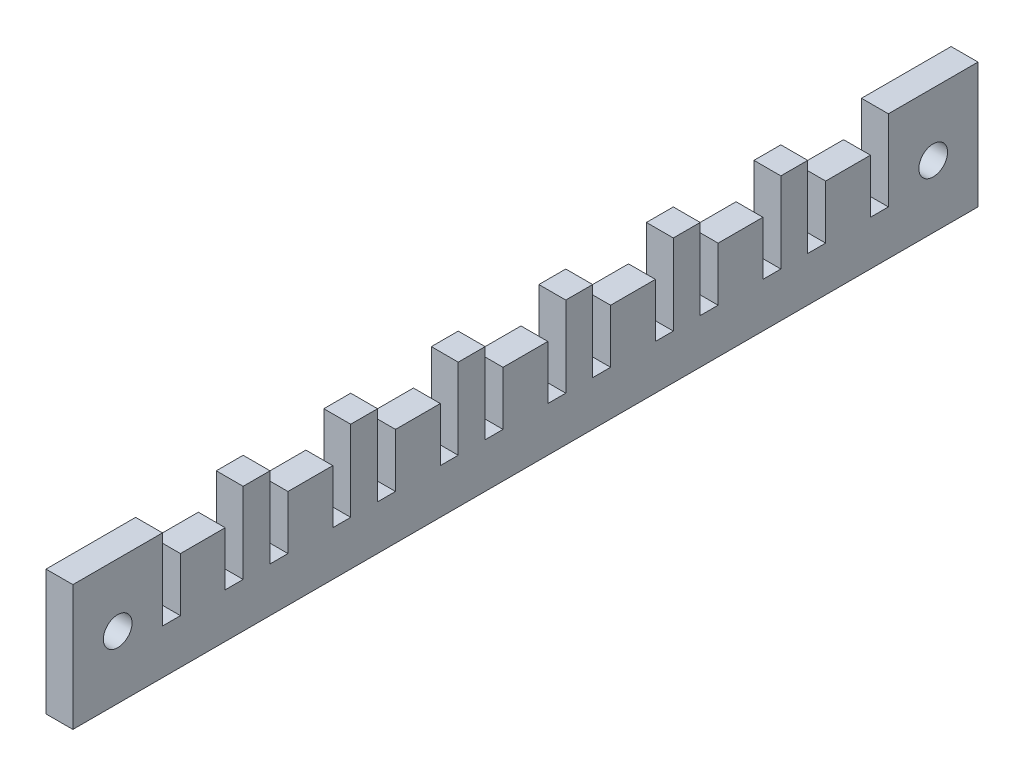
ISO-10303-21;
HEADER;
FILE_DESCRIPTION(('STEP AP214'),'2;1');
FILE_NAME('part.step','',(''),(''),'','','');
FILE_SCHEMA(('AUTOMOTIVE_DESIGN { 1 0 10303 214 1 1 1 1 }'));
ENDSEC;
DATA;
#1=APPLICATION_CONTEXT('core data for automotive mechanical design processes');
#2=APPLICATION_PROTOCOL_DEFINITION('international standard','automotive_design',2000,#1);
#3=PRODUCT_CONTEXT('',#1,'mechanical');
#4=PRODUCT('Part','Part','',(#3));
#5=PRODUCT_RELATED_PRODUCT_CATEGORY('part','',(#4));
#6=PRODUCT_DEFINITION_FORMATION('','',#4);
#7=PRODUCT_DEFINITION_CONTEXT('part definition',#1,'design');
#8=PRODUCT_DEFINITION('design','',#6,#7);
#9=PRODUCT_DEFINITION_SHAPE('','',#8);
#10=(LENGTH_UNIT() NAMED_UNIT(*) SI_UNIT(.MILLI.,.METRE.));
#11=(NAMED_UNIT(*) PLANE_ANGLE_UNIT() SI_UNIT($,.RADIAN.));
#12=(NAMED_UNIT(*) SI_UNIT($,.STERADIAN.) SOLID_ANGLE_UNIT());
#13=UNCERTAINTY_MEASURE_WITH_UNIT(LENGTH_MEASURE(1.E-05),#10,'distance_accuracy_value','');
#14=(GEOMETRIC_REPRESENTATION_CONTEXT(3) GLOBAL_UNCERTAINTY_ASSIGNED_CONTEXT((#13)) GLOBAL_UNIT_ASSIGNED_CONTEXT((#10,
#11,#12)) REPRESENTATION_CONTEXT('',''));
#15=CARTESIAN_POINT('',(0.,0.,0.));
#16=DIRECTION('',(0.,0.,1.));
#17=DIRECTION('',(1.,0.,0.));
#18=AXIS2_PLACEMENT_3D('',#15,#16,#17);
#19=CARTESIAN_POINT('',(-13.5,24.4814087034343,-50.51));
#20=DIRECTION('',(-1.,0.,0.));
#21=DIRECTION('',(0.,0.,1.));
#22=AXIS2_PLACEMENT_3D('',#19,#20,#21);
#23=PLANE('',#22);
#24=CARTESIAN_POINT('',(-13.5,7.,45.5));
#25=DIRECTION('',(-1.,0.,0.));
#26=DIRECTION('',(0.,0.,1.));
#27=AXIS2_PLACEMENT_3D('',#24,#25,#26);
#28=CIRCLE('',#27,1.6);
#29=CARTESIAN_POINT('',(-13.5,7.,47.1));
#30=VERTEX_POINT('',#29);
#31=EDGE_CURVE('E632',#30,#30,#28,.F.);
#32=ORIENTED_EDGE('',*,*,#31,.F.);
#33=EDGE_LOOP('',(#32));
#34=FACE_BOUND('',#33,.T.);
#35=DIRECTION('',(0.,1.,0.));
#36=VECTOR('',#35,1.);
#37=CARTESIAN_POINT('',(-13.5,14.,50.5));
#38=LINE('',#37,#36);
#39=CARTESIAN_POINT('',(-13.5,0.,50.5));
#40=VERTEX_POINT('',#39);
#41=CARTESIAN_POINT('',(-13.5,14.,50.5));
#42=VERTEX_POINT('',#41);
#43=EDGE_CURVE('E623',#40,#42,#38,.T.);
#44=ORIENTED_EDGE('',*,*,#43,.F.);
#45=DIRECTION('',(0.,0.,-1.));
#46=VECTOR('',#45,1.);
#47=CARTESIAN_POINT('',(-13.5,0.,0.));
#48=LINE('',#47,#46);
#49=CARTESIAN_POINT('',(-13.5,0.,-50.5));
#50=VERTEX_POINT('',#49);
#51=EDGE_CURVE('E548',#40,#50,#48,.T.);
#52=ORIENTED_EDGE('',*,*,#51,.T.);
#53=DIRECTION('',(0.,-1.,0.));
#54=VECTOR('',#53,1.);
#55=CARTESIAN_POINT('',(-13.5,14.,-50.5));
#56=LINE('',#55,#54);
#57=CARTESIAN_POINT('',(-13.5,14.,-50.5));
#58=VERTEX_POINT('',#57);
#59=EDGE_CURVE('E626',#58,#50,#56,.T.);
#60=ORIENTED_EDGE('',*,*,#59,.F.);
#61=DIRECTION('',(0.,0.,-1.));
#62=VECTOR('',#61,1.);
#63=CARTESIAN_POINT('',(-13.5,14.,0.));
#64=LINE('',#63,#62);
#65=CARTESIAN_POINT('',(-13.5,14.,-40.5));
#66=VERTEX_POINT('',#65);
#67=EDGE_CURVE('E428',#66,#58,#64,.T.);
#68=ORIENTED_EDGE('',*,*,#67,.F.);
#69=DIRECTION('',(0.,-1.,0.));
#70=VECTOR('',#69,1.);
#71=CARTESIAN_POINT('',(-13.5,14.,-40.5));
#72=LINE('',#71,#70);
#73=CARTESIAN_POINT('',(-13.5,5.,-40.5));
#74=VERTEX_POINT('',#73);
#75=EDGE_CURVE('E793',#66,#74,#72,.T.);
#76=ORIENTED_EDGE('',*,*,#75,.T.);
#77=DIRECTION('',(0.,0.,1.));
#78=VECTOR('',#77,1.);
#79=CARTESIAN_POINT('',(-13.5,5.,-40.5));
#80=LINE('',#79,#78);
#81=CARTESIAN_POINT('',(-13.5,5.,-38.5));
#82=VERTEX_POINT('',#81);
#83=EDGE_CURVE('E555',#74,#82,#80,.T.);
#84=ORIENTED_EDGE('',*,*,#83,.T.);
#85=DIRECTION('',(0.,1.,0.));
#86=VECTOR('',#85,1.);
#87=CARTESIAN_POINT('',(-13.5,-0.999999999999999,-38.5));
#88=LINE('',#87,#86);
#89=CARTESIAN_POINT('',(-13.5,11.,-38.5));
#90=VERTEX_POINT('',#89);
#91=EDGE_CURVE('E798',#82,#90,#88,.T.);
#92=ORIENTED_EDGE('',*,*,#91,.T.);
#93=DIRECTION('',(0.,0.,-1.));
#94=VECTOR('',#93,1.);
#95=CARTESIAN_POINT('',(-13.5,11.,-40.5));
#96=LINE('',#95,#94);
#97=CARTESIAN_POINT('',(-13.5,11.,-33.5));
#98=VERTEX_POINT('',#97);
#99=EDGE_CURVE('E660',#98,#90,#96,.T.);
#100=ORIENTED_EDGE('',*,*,#99,.F.);
#101=DIRECTION('',(0.,-1.,0.));
#102=VECTOR('',#101,1.);
#103=CARTESIAN_POINT('',(-13.5,-0.999999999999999,-33.5));
#104=LINE('',#103,#102);
#105=CARTESIAN_POINT('',(-13.5,5.,-33.5));
#106=VERTEX_POINT('',#105);
#107=EDGE_CURVE('E590',#98,#106,#104,.T.);
#108=ORIENTED_EDGE('',*,*,#107,.T.);
#109=CARTESIAN_POINT('',(-13.5,5.,-31.5));
#110=VERTEX_POINT('',#109);
#111=EDGE_CURVE('E910',#106,#110,#80,.T.);
#112=ORIENTED_EDGE('',*,*,#111,.T.);
#113=DIRECTION('',(0.,1.,0.));
#114=VECTOR('',#113,1.);
#115=CARTESIAN_POINT('',(-13.5,-4.,-31.5));
#116=LINE('',#115,#114);
#117=CARTESIAN_POINT('',(-13.5,14.,-31.5));
#118=VERTEX_POINT('',#117);
#119=EDGE_CURVE('E418',#110,#118,#116,.T.);
#120=ORIENTED_EDGE('',*,*,#119,.T.);
#121=CARTESIAN_POINT('',(-13.5,14.,-28.5));
#122=VERTEX_POINT('',#121);
#123=EDGE_CURVE('E421',#122,#118,#64,.T.);
#124=ORIENTED_EDGE('',*,*,#123,.F.);
#125=DIRECTION('',(0.,-1.,0.));
#126=VECTOR('',#125,1.);
#127=CARTESIAN_POINT('',(-13.5,-4.,-28.5));
#128=LINE('',#127,#126);
#129=CARTESIAN_POINT('',(-13.5,5.,-28.5));
#130=VERTEX_POINT('',#129);
#131=EDGE_CURVE('E409',#122,#130,#128,.T.);
#132=ORIENTED_EDGE('',*,*,#131,.T.);
#133=CARTESIAN_POINT('',(-13.5,5.,-26.5));
#134=VERTEX_POINT('',#133);
#135=EDGE_CURVE('E911',#130,#134,#80,.T.);
#136=ORIENTED_EDGE('',*,*,#135,.T.);
#137=DIRECTION('',(0.,1.,0.));
#138=VECTOR('',#137,1.);
#139=CARTESIAN_POINT('',(-13.5,-0.999999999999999,-26.5));
#140=LINE('',#139,#138);
#141=CARTESIAN_POINT('',(-13.5,11.,-26.5));
#142=VERTEX_POINT('',#141);
#143=EDGE_CURVE('E583',#134,#142,#140,.T.);
#144=ORIENTED_EDGE('',*,*,#143,.T.);
#145=DIRECTION('',(0.,0.,-1.));
#146=VECTOR('',#145,1.);
#147=CARTESIAN_POINT('',(-13.5,11.,-28.5));
#148=LINE('',#147,#146);
#149=CARTESIAN_POINT('',(-13.5,11.,-21.5));
#150=VERTEX_POINT('',#149);
#151=EDGE_CURVE('E656',#150,#142,#148,.T.);
#152=ORIENTED_EDGE('',*,*,#151,.F.);
#153=DIRECTION('',(0.,-1.,0.));
#154=VECTOR('',#153,1.);
#155=CARTESIAN_POINT('',(-13.5,-0.999999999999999,-21.5));
#156=LINE('',#155,#154);
#157=CARTESIAN_POINT('',(-13.5,5.,-21.5));
#158=VERTEX_POINT('',#157);
#159=EDGE_CURVE('E582',#150,#158,#156,.T.);
#160=ORIENTED_EDGE('',*,*,#159,.T.);
#161=CARTESIAN_POINT('',(-13.5,5.,-19.5));
#162=VERTEX_POINT('',#161);
#163=EDGE_CURVE('E912',#158,#162,#80,.T.);
#164=ORIENTED_EDGE('',*,*,#163,.T.);
#165=DIRECTION('',(0.,1.,0.));
#166=VECTOR('',#165,1.);
#167=CARTESIAN_POINT('',(-13.5,-4.,-19.5));
#168=LINE('',#167,#166);
#169=CARTESIAN_POINT('',(-13.5,14.,-19.5));
#170=VERTEX_POINT('',#169);
#171=EDGE_CURVE('E787',#162,#170,#168,.T.);
#172=ORIENTED_EDGE('',*,*,#171,.T.);
#173=CARTESIAN_POINT('',(-13.5,14.,-16.5));
#174=VERTEX_POINT('',#173);
#175=EDGE_CURVE('E429',#174,#170,#64,.T.);
#176=ORIENTED_EDGE('',*,*,#175,.F.);
#177=DIRECTION('',(0.,-1.,0.));
#178=VECTOR('',#177,1.);
#179=CARTESIAN_POINT('',(-13.5,-4.,-16.5));
#180=LINE('',#179,#178);
#181=CARTESIAN_POINT('',(-13.5,5.,-16.5));
#182=VERTEX_POINT('',#181);
#183=EDGE_CURVE('E784',#174,#182,#180,.T.);
#184=ORIENTED_EDGE('',*,*,#183,.T.);
#185=CARTESIAN_POINT('',(-13.5,5.,-14.5));
#186=VERTEX_POINT('',#185);
#187=EDGE_CURVE('E914',#182,#186,#80,.T.);
#188=ORIENTED_EDGE('',*,*,#187,.T.);
#189=DIRECTION('',(0.,1.,0.));
#190=VECTOR('',#189,1.);
#191=CARTESIAN_POINT('',(-13.5,-0.999999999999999,-14.5));
#192=LINE('',#191,#190);
#193=CARTESIAN_POINT('',(-13.5,11.,-14.5));
#194=VERTEX_POINT('',#193);
#195=EDGE_CURVE('E579',#186,#194,#192,.T.);
#196=ORIENTED_EDGE('',*,*,#195,.T.);
#197=DIRECTION('',(0.,0.,-1.));
#198=VECTOR('',#197,1.);
#199=CARTESIAN_POINT('',(-13.5,11.,-16.5));
#200=LINE('',#199,#198);
#201=CARTESIAN_POINT('',(-13.5,11.,-9.5));
#202=VERTEX_POINT('',#201);
#203=EDGE_CURVE('E652',#202,#194,#200,.T.);
#204=ORIENTED_EDGE('',*,*,#203,.F.);
#205=DIRECTION('',(0.,-1.,0.));
#206=VECTOR('',#205,1.);
#207=CARTESIAN_POINT('',(-13.5,-0.999999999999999,-9.5));
#208=LINE('',#207,#206);
#209=CARTESIAN_POINT('',(-13.5,5.,-9.5));
#210=VERTEX_POINT('',#209);
#211=EDGE_CURVE('E578',#202,#210,#208,.T.);
#212=ORIENTED_EDGE('',*,*,#211,.T.);
#213=CARTESIAN_POINT('',(-13.5,5.,-7.5));
#214=VERTEX_POINT('',#213);
#215=EDGE_CURVE('E916',#210,#214,#80,.T.);
#216=ORIENTED_EDGE('',*,*,#215,.T.);
#217=DIRECTION('',(0.,1.,0.));
#218=VECTOR('',#217,1.);
#219=CARTESIAN_POINT('',(-13.5,-4.,-7.5));
#220=LINE('',#219,#218);
#221=CARTESIAN_POINT('',(-13.5,14.,-7.5));
#222=VERTEX_POINT('',#221);
#223=EDGE_CURVE('E781',#214,#222,#220,.T.);
#224=ORIENTED_EDGE('',*,*,#223,.T.);
#225=CARTESIAN_POINT('',(-13.5,14.,-4.5));
#226=VERTEX_POINT('',#225);
#227=EDGE_CURVE('E1092',#226,#222,#64,.T.);
#228=ORIENTED_EDGE('',*,*,#227,.F.);
#229=DIRECTION('',(0.,-1.,0.));
#230=VECTOR('',#229,1.);
#231=CARTESIAN_POINT('',(-13.5,-4.,-4.5));
#232=LINE('',#231,#230);
#233=CARTESIAN_POINT('',(-13.5,5.,-4.5));
#234=VERTEX_POINT('',#233);
#235=EDGE_CURVE('E778',#226,#234,#232,.T.);
#236=ORIENTED_EDGE('',*,*,#235,.T.);
#237=CARTESIAN_POINT('',(-13.5,5.,-2.49999999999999));
#238=VERTEX_POINT('',#237);
#239=EDGE_CURVE('E918',#234,#238,#80,.T.);
#240=ORIENTED_EDGE('',*,*,#239,.T.);
#241=DIRECTION('',(0.,1.,0.));
#242=VECTOR('',#241,1.);
#243=CARTESIAN_POINT('',(-13.5,-0.999999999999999,-2.49999999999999));
#244=LINE('',#243,#242);
#245=CARTESIAN_POINT('',(-13.5,11.,-2.49999999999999));
#246=VERTEX_POINT('',#245);
#247=EDGE_CURVE('E575',#238,#246,#244,.T.);
#248=ORIENTED_EDGE('',*,*,#247,.T.);
#249=DIRECTION('',(0.,0.,-1.));
#250=VECTOR('',#249,1.);
#251=CARTESIAN_POINT('',(-13.5,11.,-4.49999999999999));
#252=LINE('',#251,#250);
#253=CARTESIAN_POINT('',(-13.5,11.,2.5));
#254=VERTEX_POINT('',#253);
#255=EDGE_CURVE('E648',#254,#246,#252,.T.);
#256=ORIENTED_EDGE('',*,*,#255,.F.);
#257=DIRECTION('',(0.,-1.,0.));
#258=VECTOR('',#257,1.);
#259=CARTESIAN_POINT('',(-13.5,-0.999999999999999,2.5));
#260=LINE('',#259,#258);
#261=CARTESIAN_POINT('',(-13.5,5.,2.5));
#262=VERTEX_POINT('',#261);
#263=EDGE_CURVE('E574',#254,#262,#260,.T.);
#264=ORIENTED_EDGE('',*,*,#263,.T.);
#265=CARTESIAN_POINT('',(-13.5,5.,4.50000000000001));
#266=VERTEX_POINT('',#265);
#267=EDGE_CURVE('E920',#262,#266,#80,.T.);
#268=ORIENTED_EDGE('',*,*,#267,.T.);
#269=DIRECTION('',(0.,1.,0.));
#270=VECTOR('',#269,1.);
#271=CARTESIAN_POINT('',(-13.5,-4.,4.50000000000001));
#272=LINE('',#271,#270);
#273=CARTESIAN_POINT('',(-13.5,14.,4.50000000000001));
#274=VERTEX_POINT('',#273);
#275=EDGE_CURVE('E775',#266,#274,#272,.T.);
#276=ORIENTED_EDGE('',*,*,#275,.T.);
#277=CARTESIAN_POINT('',(-13.5,14.,7.50000000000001));
#278=VERTEX_POINT('',#277);
#279=EDGE_CURVE('E1094',#278,#274,#64,.T.);
#280=ORIENTED_EDGE('',*,*,#279,.F.);
#281=DIRECTION('',(0.,-1.,0.));
#282=VECTOR('',#281,1.);
#283=CARTESIAN_POINT('',(-13.5,-4.,7.50000000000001));
#284=LINE('',#283,#282);
#285=CARTESIAN_POINT('',(-13.5,5.,7.50000000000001));
#286=VERTEX_POINT('',#285);
#287=EDGE_CURVE('E772',#278,#286,#284,.T.);
#288=ORIENTED_EDGE('',*,*,#287,.T.);
#289=CARTESIAN_POINT('',(-13.5,5.,9.50000000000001));
#290=VERTEX_POINT('',#289);
#291=EDGE_CURVE('E922',#286,#290,#80,.T.);
#292=ORIENTED_EDGE('',*,*,#291,.T.);
#293=DIRECTION('',(0.,1.,0.));
#294=VECTOR('',#293,1.);
#295=CARTESIAN_POINT('',(-13.5,-0.999999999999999,9.50000000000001));
#296=LINE('',#295,#294);
#297=CARTESIAN_POINT('',(-13.5,11.,9.50000000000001));
#298=VERTEX_POINT('',#297);
#299=EDGE_CURVE('E570',#290,#298,#296,.T.);
#300=ORIENTED_EDGE('',*,*,#299,.T.);
#301=DIRECTION('',(0.,0.,-1.));
#302=VECTOR('',#301,1.);
#303=CARTESIAN_POINT('',(-13.5,11.,7.50000000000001));
#304=LINE('',#303,#302);
#305=CARTESIAN_POINT('',(-13.5,11.,14.5));
#306=VERTEX_POINT('',#305);
#307=EDGE_CURVE('E644',#306,#298,#304,.T.);
#308=ORIENTED_EDGE('',*,*,#307,.F.);
#309=DIRECTION('',(0.,-1.,0.));
#310=VECTOR('',#309,1.);
#311=CARTESIAN_POINT('',(-13.5,-0.999999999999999,14.5));
#312=LINE('',#311,#310);
#313=CARTESIAN_POINT('',(-13.5,5.,14.5));
#314=VERTEX_POINT('',#313);
#315=EDGE_CURVE('E569',#306,#314,#312,.T.);
#316=ORIENTED_EDGE('',*,*,#315,.T.);
#317=CARTESIAN_POINT('',(-13.5,5.,16.5));
#318=VERTEX_POINT('',#317);
#319=EDGE_CURVE('E924',#314,#318,#80,.T.);
#320=ORIENTED_EDGE('',*,*,#319,.T.);
#321=DIRECTION('',(0.,1.,0.));
#322=VECTOR('',#321,1.);
#323=CARTESIAN_POINT('',(-13.5,-4.,16.5));
#324=LINE('',#323,#322);
#325=CARTESIAN_POINT('',(-13.5,14.,16.5));
#326=VERTEX_POINT('',#325);
#327=EDGE_CURVE('E769',#318,#326,#324,.T.);
#328=ORIENTED_EDGE('',*,*,#327,.T.);
#329=CARTESIAN_POINT('',(-13.5,14.,19.5));
#330=VERTEX_POINT('',#329);
#331=EDGE_CURVE('E1111',#330,#326,#64,.T.);
#332=ORIENTED_EDGE('',*,*,#331,.F.);
#333=DIRECTION('',(0.,-1.,0.));
#334=VECTOR('',#333,1.);
#335=CARTESIAN_POINT('',(-13.5,-4.,19.5));
#336=LINE('',#335,#334);
#337=CARTESIAN_POINT('',(-13.5,5.,19.5));
#338=VERTEX_POINT('',#337);
#339=EDGE_CURVE('E766',#330,#338,#336,.T.);
#340=ORIENTED_EDGE('',*,*,#339,.T.);
#341=CARTESIAN_POINT('',(-13.5,5.,21.5));
#342=VERTEX_POINT('',#341);
#343=EDGE_CURVE('E926',#338,#342,#80,.T.);
#344=ORIENTED_EDGE('',*,*,#343,.T.);
#345=DIRECTION('',(0.,1.,0.));
#346=VECTOR('',#345,1.);
#347=CARTESIAN_POINT('',(-13.5,-0.999999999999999,21.5));
#348=LINE('',#347,#346);
#349=CARTESIAN_POINT('',(-13.5,11.,21.5));
#350=VERTEX_POINT('',#349);
#351=EDGE_CURVE('E565',#342,#350,#348,.T.);
#352=ORIENTED_EDGE('',*,*,#351,.T.);
#353=DIRECTION('',(0.,0.,-1.));
#354=VECTOR('',#353,1.);
#355=CARTESIAN_POINT('',(-13.5,11.,19.5));
#356=LINE('',#355,#354);
#357=CARTESIAN_POINT('',(-13.5,11.,26.5));
#358=VERTEX_POINT('',#357);
#359=EDGE_CURVE('E640',#358,#350,#356,.T.);
#360=ORIENTED_EDGE('',*,*,#359,.F.);
#361=DIRECTION('',(0.,-1.,0.));
#362=VECTOR('',#361,1.);
#363=CARTESIAN_POINT('',(-13.5,-0.999999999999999,26.5));
#364=LINE('',#363,#362);
#365=CARTESIAN_POINT('',(-13.5,5.,26.5));
#366=VERTEX_POINT('',#365);
#367=EDGE_CURVE('E564',#358,#366,#364,.T.);
#368=ORIENTED_EDGE('',*,*,#367,.T.);
#369=CARTESIAN_POINT('',(-13.5,5.,28.5));
#370=VERTEX_POINT('',#369);
#371=EDGE_CURVE('E928',#366,#370,#80,.T.);
#372=ORIENTED_EDGE('',*,*,#371,.T.);
#373=DIRECTION('',(0.,1.,0.));
#374=VECTOR('',#373,1.);
#375=CARTESIAN_POINT('',(-13.5,-4.,28.5));
#376=LINE('',#375,#374);
#377=CARTESIAN_POINT('',(-13.5,14.,28.5));
#378=VERTEX_POINT('',#377);
#379=EDGE_CURVE('E763',#370,#378,#376,.T.);
#380=ORIENTED_EDGE('',*,*,#379,.T.);
#381=CARTESIAN_POINT('',(-13.5,14.,31.5));
#382=VERTEX_POINT('',#381);
#383=EDGE_CURVE('E622',#382,#378,#64,.T.);
#384=ORIENTED_EDGE('',*,*,#383,.F.);
#385=DIRECTION('',(0.,-1.,0.));
#386=VECTOR('',#385,1.);
#387=CARTESIAN_POINT('',(-13.5,-4.,31.5));
#388=LINE('',#387,#386);
#389=CARTESIAN_POINT('',(-13.5,5.,31.5));
#390=VERTEX_POINT('',#389);
#391=EDGE_CURVE('E760',#382,#390,#388,.T.);
#392=ORIENTED_EDGE('',*,*,#391,.T.);
#393=CARTESIAN_POINT('',(-13.5,5.,33.5));
#394=VERTEX_POINT('',#393);
#395=EDGE_CURVE('E618',#390,#394,#80,.T.);
#396=ORIENTED_EDGE('',*,*,#395,.T.);
#397=DIRECTION('',(0.,1.,0.));
#398=VECTOR('',#397,1.);
#399=CARTESIAN_POINT('',(-13.5,-0.999999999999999,33.5));
#400=LINE('',#399,#398);
#401=CARTESIAN_POINT('',(-13.5,11.,33.5));
#402=VERTEX_POINT('',#401);
#403=EDGE_CURVE('E560',#394,#402,#400,.T.);
#404=ORIENTED_EDGE('',*,*,#403,.T.);
#405=DIRECTION('',(0.,0.,-1.));
#406=VECTOR('',#405,1.);
#407=CARTESIAN_POINT('',(-13.5,11.,31.5));
#408=LINE('',#407,#406);
#409=CARTESIAN_POINT('',(-13.5,11.,38.5));
#410=VERTEX_POINT('',#409);
#411=EDGE_CURVE('E636',#410,#402,#408,.T.);
#412=ORIENTED_EDGE('',*,*,#411,.F.);
#413=DIRECTION('',(0.,-1.,0.));
#414=VECTOR('',#413,1.);
#415=CARTESIAN_POINT('',(-13.5,-0.999999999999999,38.5));
#416=LINE('',#415,#414);
#417=CARTESIAN_POINT('',(-13.5,5.,38.5));
#418=VERTEX_POINT('',#417);
#419=EDGE_CURVE('E796',#410,#418,#416,.T.);
#420=ORIENTED_EDGE('',*,*,#419,.T.);
#421=CARTESIAN_POINT('',(-13.5,5.,40.5));
#422=VERTEX_POINT('',#421);
#423=EDGE_CURVE('E559',#418,#422,#80,.T.);
#424=ORIENTED_EDGE('',*,*,#423,.T.);
#425=DIRECTION('',(0.,1.,0.));
#426=VECTOR('',#425,1.);
#427=CARTESIAN_POINT('',(-13.5,14.,40.5));
#428=LINE('',#427,#426);
#429=CARTESIAN_POINT('',(-13.5,14.,40.5));
#430=VERTEX_POINT('',#429);
#431=EDGE_CURVE('E790',#422,#430,#428,.T.);
#432=ORIENTED_EDGE('',*,*,#431,.T.);
#433=EDGE_CURVE('E620',#42,#430,#64,.T.);
#434=ORIENTED_EDGE('',*,*,#433,.F.);
#435=EDGE_LOOP('',(#44,#52,#60,#68,#76,#84,#92,#100,#108,#112,#120,#124,#132,#136,#144,#152,
#160,#164,#172,#176,#184,#188,#196,#204,#212,#216,#224,#228,#236,#240,#248,#256,#264,#268,#276,
#280,#288,#292,#300,#308,#316,#320,#328,#332,#340,#344,#352,#360,#368,#372,#380,#384,#392,#396,
#404,#412,#420,#424,#432,#434));
#436=FACE_BOUND('',#435,.T.);
#437=CARTESIAN_POINT('',(-13.5,7.,-45.5));
#438=DIRECTION('',(-1.,0.,0.));
#439=DIRECTION('',(0.,0.,1.));
#440=AXIS2_PLACEMENT_3D('',#437,#438,#439);
#441=CIRCLE('',#440,1.6);
#442=CARTESIAN_POINT('',(-13.5,7.,-43.9));
#443=VERTEX_POINT('',#442);
#444=EDGE_CURVE('E629',#443,#443,#441,.F.);
#445=ORIENTED_EDGE('',*,*,#444,.F.);
#446=EDGE_LOOP('',(#445));
#447=FACE_BOUND('',#446,.T.);
#448=ADVANCED_FACE('F32',(#34,#436,#447),#23,.F.);
#449=CARTESIAN_POINT('',(-16.5,24.4814087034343,-50.51));
#450=DIRECTION('',(-1.,0.,0.));
#451=DIRECTION('',(0.,0.,1.));
#452=AXIS2_PLACEMENT_3D('',#449,#450,#451);
#453=PLANE('',#452);
#454=CARTESIAN_POINT('',(-16.5,7.,-45.5));
#455=DIRECTION('',(-1.,0.,0.));
#456=DIRECTION('',(0.,0.,1.));
#457=AXIS2_PLACEMENT_3D('',#454,#455,#456);
#458=CIRCLE('',#457,1.6);
#459=CARTESIAN_POINT('',(-16.5,7.,-43.9));
#460=VERTEX_POINT('',#459);
#461=EDGE_CURVE('E549',#460,#460,#458,.F.);
#462=ORIENTED_EDGE('',*,*,#461,.T.);
#463=EDGE_LOOP('',(#462));
#464=FACE_BOUND('',#463,.T.);
#465=DIRECTION('',(0.,1.,0.));
#466=VECTOR('',#465,1.);
#467=CARTESIAN_POINT('',(-16.5,14.,50.5));
#468=LINE('',#467,#466);
#469=CARTESIAN_POINT('',(-16.5,0.,50.5));
#470=VERTEX_POINT('',#469);
#471=CARTESIAN_POINT('',(-16.5,14.,50.5));
#472=VERTEX_POINT('',#471);
#473=EDGE_CURVE('E541',#470,#472,#468,.T.);
#474=ORIENTED_EDGE('',*,*,#473,.T.);
#475=DIRECTION('',(0.,0.,-1.));
#476=VECTOR('',#475,1.);
#477=CARTESIAN_POINT('',(-16.5,14.,0.));
#478=LINE('',#477,#476);
#479=CARTESIAN_POINT('',(-16.5,14.,40.5));
#480=VERTEX_POINT('',#479);
#481=EDGE_CURVE('E542',#472,#480,#478,.T.);
#482=ORIENTED_EDGE('',*,*,#481,.T.);
#483=DIRECTION('',(0.,1.,0.));
#484=VECTOR('',#483,1.);
#485=CARTESIAN_POINT('',(-16.5,14.,40.5));
#486=LINE('',#485,#484);
#487=CARTESIAN_POINT('',(-16.5,5.,40.5));
#488=VERTEX_POINT('',#487);
#489=EDGE_CURVE('E751',#488,#480,#486,.T.);
#490=ORIENTED_EDGE('',*,*,#489,.F.);
#491=DIRECTION('',(0.,0.,1.));
#492=VECTOR('',#491,1.);
#493=CARTESIAN_POINT('',(-16.5,5.,-40.5));
#494=LINE('',#493,#492);
#495=CARTESIAN_POINT('',(-16.5,5.,38.5));
#496=VERTEX_POINT('',#495);
#497=EDGE_CURVE('E639',#496,#488,#494,.T.);
#498=ORIENTED_EDGE('',*,*,#497,.F.);
#499=DIRECTION('',(0.,-1.,0.));
#500=VECTOR('',#499,1.);
#501=CARTESIAN_POINT('',(-16.5,-0.999999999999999,38.5));
#502=LINE('',#501,#500);
#503=CARTESIAN_POINT('',(-16.5,11.,38.5));
#504=VERTEX_POINT('',#503);
#505=EDGE_CURVE('E805',#504,#496,#502,.T.);
#506=ORIENTED_EDGE('',*,*,#505,.F.);
#507=DIRECTION('',(0.,0.,-1.));
#508=VECTOR('',#507,1.);
#509=CARTESIAN_POINT('',(-16.5,11.,31.5));
#510=LINE('',#509,#508);
#511=CARTESIAN_POINT('',(-16.5,11.,33.5));
#512=VERTEX_POINT('',#511);
#513=EDGE_CURVE('E556',#504,#512,#510,.T.);
#514=ORIENTED_EDGE('',*,*,#513,.T.);
#515=DIRECTION('',(0.,1.,0.));
#516=VECTOR('',#515,1.);
#517=CARTESIAN_POINT('',(-16.5,-0.999999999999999,33.5));
#518=LINE('',#517,#516);
#519=CARTESIAN_POINT('',(-16.5,5.,33.5));
#520=VERTEX_POINT('',#519);
#521=EDGE_CURVE('E638',#520,#512,#518,.T.);
#522=ORIENTED_EDGE('',*,*,#521,.F.);
#523=CARTESIAN_POINT('',(-16.5,5.,31.5));
#524=VERTEX_POINT('',#523);
#525=EDGE_CURVE('E851',#524,#520,#494,.T.);
#526=ORIENTED_EDGE('',*,*,#525,.F.);
#527=DIRECTION('',(0.,-1.,0.));
#528=VECTOR('',#527,1.);
#529=CARTESIAN_POINT('',(-16.5,-4.,31.5));
#530=LINE('',#529,#528);
#531=CARTESIAN_POINT('',(-16.5,14.,31.5));
#532=VERTEX_POINT('',#531);
#533=EDGE_CURVE('E755',#532,#524,#530,.T.);
#534=ORIENTED_EDGE('',*,*,#533,.F.);
#535=CARTESIAN_POINT('',(-16.5,14.,28.5));
#536=VERTEX_POINT('',#535);
#537=EDGE_CURVE('E845',#532,#536,#478,.T.);
#538=ORIENTED_EDGE('',*,*,#537,.T.);
#539=DIRECTION('',(0.,1.,0.));
#540=VECTOR('',#539,1.);
#541=CARTESIAN_POINT('',(-16.5,-4.,28.5));
#542=LINE('',#541,#540);
#543=CARTESIAN_POINT('',(-16.5,5.,28.5));
#544=VERTEX_POINT('',#543);
#545=EDGE_CURVE('E829',#544,#536,#542,.T.);
#546=ORIENTED_EDGE('',*,*,#545,.F.);
#547=CARTESIAN_POINT('',(-16.5,5.,26.5));
#548=VERTEX_POINT('',#547);
#549=EDGE_CURVE('E853',#548,#544,#494,.T.);
#550=ORIENTED_EDGE('',*,*,#549,.F.);
#551=DIRECTION('',(0.,-1.,0.));
#552=VECTOR('',#551,1.);
#553=CARTESIAN_POINT('',(-16.5,-0.999999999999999,26.5));
#554=LINE('',#553,#552);
#555=CARTESIAN_POINT('',(-16.5,11.,26.5));
#556=VERTEX_POINT('',#555);
#557=EDGE_CURVE('E643',#556,#548,#554,.T.);
#558=ORIENTED_EDGE('',*,*,#557,.F.);
#559=DIRECTION('',(0.,0.,-1.));
#560=VECTOR('',#559,1.);
#561=CARTESIAN_POINT('',(-16.5,11.,19.5));
#562=LINE('',#561,#560);
#563=CARTESIAN_POINT('',(-16.5,11.,21.5));
#564=VERTEX_POINT('',#563);
#565=EDGE_CURVE('E561',#556,#564,#562,.T.);
#566=ORIENTED_EDGE('',*,*,#565,.T.);
#567=DIRECTION('',(0.,1.,0.));
#568=VECTOR('',#567,1.);
#569=CARTESIAN_POINT('',(-16.5,-0.999999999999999,21.5));
#570=LINE('',#569,#568);
#571=CARTESIAN_POINT('',(-16.5,5.,21.5));
#572=VERTEX_POINT('',#571);
#573=EDGE_CURVE('E642',#572,#564,#570,.T.);
#574=ORIENTED_EDGE('',*,*,#573,.F.);
#575=CARTESIAN_POINT('',(-16.5,5.,19.5));
#576=VERTEX_POINT('',#575);
#577=EDGE_CURVE('E858',#576,#572,#494,.T.);
#578=ORIENTED_EDGE('',*,*,#577,.F.);
#579=DIRECTION('',(0.,-1.,0.));
#580=VECTOR('',#579,1.);
#581=CARTESIAN_POINT('',(-16.5,-4.,19.5));
#582=LINE('',#581,#580);
#583=CARTESIAN_POINT('',(-16.5,14.,19.5));
#584=VERTEX_POINT('',#583);
#585=EDGE_CURVE('E827',#584,#576,#582,.T.);
#586=ORIENTED_EDGE('',*,*,#585,.F.);
#587=CARTESIAN_POINT('',(-16.5,14.,16.5));
#588=VERTEX_POINT('',#587);
#589=EDGE_CURVE('E951',#584,#588,#478,.T.);
#590=ORIENTED_EDGE('',*,*,#589,.T.);
#591=DIRECTION('',(0.,1.,0.));
#592=VECTOR('',#591,1.);
#593=CARTESIAN_POINT('',(-16.5,-4.,16.5));
#594=LINE('',#593,#592);
#595=CARTESIAN_POINT('',(-16.5,5.,16.5));
#596=VERTEX_POINT('',#595);
#597=EDGE_CURVE('E823',#596,#588,#594,.T.);
#598=ORIENTED_EDGE('',*,*,#597,.F.);
#599=CARTESIAN_POINT('',(-16.5,5.,14.5));
#600=VERTEX_POINT('',#599);
#601=EDGE_CURVE('E863',#600,#596,#494,.T.);
#602=ORIENTED_EDGE('',*,*,#601,.F.);
#603=DIRECTION('',(0.,-1.,0.));
#604=VECTOR('',#603,1.);
#605=CARTESIAN_POINT('',(-16.5,-0.999999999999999,14.5));
#606=LINE('',#605,#604);
#607=CARTESIAN_POINT('',(-16.5,11.,14.5));
#608=VERTEX_POINT('',#607);
#609=EDGE_CURVE('E647',#608,#600,#606,.T.);
#610=ORIENTED_EDGE('',*,*,#609,.F.);
#611=DIRECTION('',(0.,0.,-1.));
#612=VECTOR('',#611,1.);
#613=CARTESIAN_POINT('',(-16.5,11.,7.50000000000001));
#614=LINE('',#613,#612);
#615=CARTESIAN_POINT('',(-16.5,11.,9.50000000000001));
#616=VERTEX_POINT('',#615);
#617=EDGE_CURVE('E566',#608,#616,#614,.T.);
#618=ORIENTED_EDGE('',*,*,#617,.T.);
#619=DIRECTION('',(0.,1.,0.));
#620=VECTOR('',#619,1.);
#621=CARTESIAN_POINT('',(-16.5,-0.999999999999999,9.50000000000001));
#622=LINE('',#621,#620);
#623=CARTESIAN_POINT('',(-16.5,5.,9.50000000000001));
#624=VERTEX_POINT('',#623);
#625=EDGE_CURVE('E646',#624,#616,#622,.T.);
#626=ORIENTED_EDGE('',*,*,#625,.F.);
#627=CARTESIAN_POINT('',(-16.5,5.,7.50000000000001));
#628=VERTEX_POINT('',#627);
#629=EDGE_CURVE('E868',#628,#624,#494,.T.);
#630=ORIENTED_EDGE('',*,*,#629,.F.);
#631=DIRECTION('',(0.,-1.,0.));
#632=VECTOR('',#631,1.);
#633=CARTESIAN_POINT('',(-16.5,-4.,7.50000000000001));
#634=LINE('',#633,#632);
#635=CARTESIAN_POINT('',(-16.5,14.,7.50000000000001));
#636=VERTEX_POINT('',#635);
#637=EDGE_CURVE('E821',#636,#628,#634,.T.);
#638=ORIENTED_EDGE('',*,*,#637,.F.);
#639=CARTESIAN_POINT('',(-16.5,14.,4.50000000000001));
#640=VERTEX_POINT('',#639);
#641=EDGE_CURVE('E953',#636,#640,#478,.T.);
#642=ORIENTED_EDGE('',*,*,#641,.T.);
#643=DIRECTION('',(0.,1.,0.));
#644=VECTOR('',#643,1.);
#645=CARTESIAN_POINT('',(-16.5,-4.,4.50000000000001));
#646=LINE('',#645,#644);
#647=CARTESIAN_POINT('',(-16.5,5.,4.50000000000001));
#648=VERTEX_POINT('',#647);
#649=EDGE_CURVE('E816',#648,#640,#646,.T.);
#650=ORIENTED_EDGE('',*,*,#649,.F.);
#651=CARTESIAN_POINT('',(-16.5,5.,2.5));
#652=VERTEX_POINT('',#651);
#653=EDGE_CURVE('E873',#652,#648,#494,.T.);
#654=ORIENTED_EDGE('',*,*,#653,.F.);
#655=DIRECTION('',(0.,-1.,0.));
#656=VECTOR('',#655,1.);
#657=CARTESIAN_POINT('',(-16.5,-0.999999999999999,2.5));
#658=LINE('',#657,#656);
#659=CARTESIAN_POINT('',(-16.5,11.,2.5));
#660=VERTEX_POINT('',#659);
#661=EDGE_CURVE('E651',#660,#652,#658,.T.);
#662=ORIENTED_EDGE('',*,*,#661,.F.);
#663=DIRECTION('',(0.,0.,-1.));
#664=VECTOR('',#663,1.);
#665=CARTESIAN_POINT('',(-16.5,11.,-4.49999999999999));
#666=LINE('',#665,#664);
#667=CARTESIAN_POINT('',(-16.5,11.,-2.49999999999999));
#668=VERTEX_POINT('',#667);
#669=EDGE_CURVE('E571',#660,#668,#666,.T.);
#670=ORIENTED_EDGE('',*,*,#669,.T.);
#671=DIRECTION('',(0.,1.,0.));
#672=VECTOR('',#671,1.);
#673=CARTESIAN_POINT('',(-16.5,-0.999999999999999,-2.49999999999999));
#674=LINE('',#673,#672);
#675=CARTESIAN_POINT('',(-16.5,5.,-2.49999999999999));
#676=VERTEX_POINT('',#675);
#677=EDGE_CURVE('E650',#676,#668,#674,.T.);
#678=ORIENTED_EDGE('',*,*,#677,.F.);
#679=CARTESIAN_POINT('',(-16.5,5.,-4.5));
#680=VERTEX_POINT('',#679);
#681=EDGE_CURVE('E878',#680,#676,#494,.T.);
#682=ORIENTED_EDGE('',*,*,#681,.F.);
#683=DIRECTION('',(0.,-1.,0.));
#684=VECTOR('',#683,1.);
#685=CARTESIAN_POINT('',(-16.5,-4.,-4.5));
#686=LINE('',#685,#684);
#687=CARTESIAN_POINT('',(-16.5,14.,-4.5));
#688=VERTEX_POINT('',#687);
#689=EDGE_CURVE('E813',#688,#680,#686,.T.);
#690=ORIENTED_EDGE('',*,*,#689,.F.);
#691=CARTESIAN_POINT('',(-16.5,14.,-7.49999999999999));
#692=VERTEX_POINT('',#691);
#693=EDGE_CURVE('E956',#688,#692,#478,.T.);
#694=ORIENTED_EDGE('',*,*,#693,.T.);
#695=DIRECTION('',(0.,1.,0.));
#696=VECTOR('',#695,1.);
#697=CARTESIAN_POINT('',(-16.5,-4.,-7.49999999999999));
#698=LINE('',#697,#696);
#699=CARTESIAN_POINT('',(-16.5,5.,-7.49999999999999));
#700=VERTEX_POINT('',#699);
#701=EDGE_CURVE('E811',#700,#692,#698,.T.);
#702=ORIENTED_EDGE('',*,*,#701,.F.);
#703=CARTESIAN_POINT('',(-16.5,5.,-9.5));
#704=VERTEX_POINT('',#703);
#705=EDGE_CURVE('E883',#704,#700,#494,.T.);
#706=ORIENTED_EDGE('',*,*,#705,.F.);
#707=DIRECTION('',(0.,-1.,0.));
#708=VECTOR('',#707,1.);
#709=CARTESIAN_POINT('',(-16.5,-0.999999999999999,-9.5));
#710=LINE('',#709,#708);
#711=CARTESIAN_POINT('',(-16.5,11.,-9.5));
#712=VERTEX_POINT('',#711);
#713=EDGE_CURVE('E655',#712,#704,#710,.T.);
#714=ORIENTED_EDGE('',*,*,#713,.F.);
#715=DIRECTION('',(0.,0.,-1.));
#716=VECTOR('',#715,1.);
#717=CARTESIAN_POINT('',(-16.5,11.,-16.5));
#718=LINE('',#717,#716);
#719=CARTESIAN_POINT('',(-16.5,11.,-14.5));
#720=VERTEX_POINT('',#719);
#721=EDGE_CURVE('E576',#712,#720,#718,.T.);
#722=ORIENTED_EDGE('',*,*,#721,.T.);
#723=DIRECTION('',(0.,1.,0.));
#724=VECTOR('',#723,1.);
#725=CARTESIAN_POINT('',(-16.5,-0.999999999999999,-14.5));
#726=LINE('',#725,#724);
#727=CARTESIAN_POINT('',(-16.5,5.,-14.5));
#728=VERTEX_POINT('',#727);
#729=EDGE_CURVE('E654',#728,#720,#726,.T.);
#730=ORIENTED_EDGE('',*,*,#729,.F.);
#731=CARTESIAN_POINT('',(-16.5,5.,-16.5));
#732=VERTEX_POINT('',#731);
#733=EDGE_CURVE('E888',#732,#728,#494,.T.);
#734=ORIENTED_EDGE('',*,*,#733,.F.);
#735=DIRECTION('',(0.,-1.,0.));
#736=VECTOR('',#735,1.);
#737=CARTESIAN_POINT('',(-16.5,-4.,-16.5));
#738=LINE('',#737,#736);
#739=CARTESIAN_POINT('',(-16.5,14.,-16.5));
#740=VERTEX_POINT('',#739);
#741=EDGE_CURVE('E747',#740,#732,#738,.T.);
#742=ORIENTED_EDGE('',*,*,#741,.F.);
#743=CARTESIAN_POINT('',(-16.5,14.,-19.5));
#744=VERTEX_POINT('',#743);
#745=EDGE_CURVE('E959',#740,#744,#478,.T.);
#746=ORIENTED_EDGE('',*,*,#745,.T.);
#747=DIRECTION('',(0.,1.,0.));
#748=VECTOR('',#747,1.);
#749=CARTESIAN_POINT('',(-16.5,-4.,-19.5));
#750=LINE('',#749,#748);
#751=CARTESIAN_POINT('',(-16.5,5.,-19.5));
#752=VERTEX_POINT('',#751);
#753=EDGE_CURVE('E749',#752,#744,#750,.T.);
#754=ORIENTED_EDGE('',*,*,#753,.F.);
#755=CARTESIAN_POINT('',(-16.5,5.,-21.5));
#756=VERTEX_POINT('',#755);
#757=EDGE_CURVE('E893',#756,#752,#494,.T.);
#758=ORIENTED_EDGE('',*,*,#757,.F.);
#759=DIRECTION('',(0.,-1.,0.));
#760=VECTOR('',#759,1.);
#761=CARTESIAN_POINT('',(-16.5,-0.999999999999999,-21.5));
#762=LINE('',#761,#760);
#763=CARTESIAN_POINT('',(-16.5,11.,-21.5));
#764=VERTEX_POINT('',#763);
#765=EDGE_CURVE('E659',#764,#756,#762,.T.);
#766=ORIENTED_EDGE('',*,*,#765,.F.);
#767=DIRECTION('',(0.,0.,-1.));
#768=VECTOR('',#767,1.);
#769=CARTESIAN_POINT('',(-16.5,11.,-28.5));
#770=LINE('',#769,#768);
#771=CARTESIAN_POINT('',(-16.5,11.,-26.5));
#772=VERTEX_POINT('',#771);
#773=EDGE_CURVE('E580',#764,#772,#770,.T.);
#774=ORIENTED_EDGE('',*,*,#773,.T.);
#775=DIRECTION('',(0.,1.,0.));
#776=VECTOR('',#775,1.);
#777=CARTESIAN_POINT('',(-16.5,-0.999999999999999,-26.5));
#778=LINE('',#777,#776);
#779=CARTESIAN_POINT('',(-16.5,5.,-26.5));
#780=VERTEX_POINT('',#779);
#781=EDGE_CURVE('E658',#780,#772,#778,.T.);
#782=ORIENTED_EDGE('',*,*,#781,.F.);
#783=CARTESIAN_POINT('',(-16.5,5.,-28.5));
#784=VERTEX_POINT('',#783);
#785=EDGE_CURVE('E898',#784,#780,#494,.T.);
#786=ORIENTED_EDGE('',*,*,#785,.F.);
#787=DIRECTION('',(0.,-1.,0.));
#788=VECTOR('',#787,1.);
#789=CARTESIAN_POINT('',(-16.5,-4.,-28.5));
#790=LINE('',#789,#788);
#791=CARTESIAN_POINT('',(-16.5,14.,-28.5));
#792=VERTEX_POINT('',#791);
#793=EDGE_CURVE('E49',#792,#784,#790,.T.);
#794=ORIENTED_EDGE('',*,*,#793,.F.);
#795=CARTESIAN_POINT('',(-16.5,14.,-31.5));
#796=VERTEX_POINT('',#795);
#797=EDGE_CURVE('E432',#792,#796,#478,.T.);
#798=ORIENTED_EDGE('',*,*,#797,.T.);
#799=DIRECTION('',(0.,1.,0.));
#800=VECTOR('',#799,1.);
#801=CARTESIAN_POINT('',(-16.5,-4.,-31.5));
#802=LINE('',#801,#800);
#803=CARTESIAN_POINT('',(-16.5,5.,-31.5));
#804=VERTEX_POINT('',#803);
#805=EDGE_CURVE('E753',#804,#796,#802,.T.);
#806=ORIENTED_EDGE('',*,*,#805,.F.);
#807=CARTESIAN_POINT('',(-16.5,5.,-33.5));
#808=VERTEX_POINT('',#807);
#809=EDGE_CURVE('E742',#808,#804,#494,.T.);
#810=ORIENTED_EDGE('',*,*,#809,.F.);
#811=DIRECTION('',(0.,-1.,0.));
#812=VECTOR('',#811,1.);
#813=CARTESIAN_POINT('',(-16.5,-0.999999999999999,-33.5));
#814=LINE('',#813,#812);
#815=CARTESIAN_POINT('',(-16.5,11.,-33.5));
#816=VERTEX_POINT('',#815);
#817=EDGE_CURVE('E662',#816,#808,#814,.T.);
#818=ORIENTED_EDGE('',*,*,#817,.F.);
#819=DIRECTION('',(0.,0.,-1.));
#820=VECTOR('',#819,1.);
#821=CARTESIAN_POINT('',(-16.5,11.,-40.5));
#822=LINE('',#821,#820);
#823=CARTESIAN_POINT('',(-16.5,11.,-38.5));
#824=VERTEX_POINT('',#823);
#825=EDGE_CURVE('E36',#816,#824,#822,.T.);
#826=ORIENTED_EDGE('',*,*,#825,.T.);
#827=DIRECTION('',(0.,1.,0.));
#828=VECTOR('',#827,1.);
#829=CARTESIAN_POINT('',(-16.5,-0.999999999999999,-38.5));
#830=LINE('',#829,#828);
#831=CARTESIAN_POINT('',(-16.5,5.,-38.5));
#832=VERTEX_POINT('',#831);
#833=EDGE_CURVE('E661',#832,#824,#830,.T.);
#834=ORIENTED_EDGE('',*,*,#833,.F.);
#835=CARTESIAN_POINT('',(-16.5,5.,-40.5));
#836=VERTEX_POINT('',#835);
#837=EDGE_CURVE('E635',#836,#832,#494,.T.);
#838=ORIENTED_EDGE('',*,*,#837,.F.);
#839=DIRECTION('',(0.,-1.,0.));
#840=VECTOR('',#839,1.);
#841=CARTESIAN_POINT('',(-16.5,14.,-40.5));
#842=LINE('',#841,#840);
#843=CARTESIAN_POINT('',(-16.5,14.,-40.5));
#844=VERTEX_POINT('',#843);
#845=EDGE_CURVE('E806',#844,#836,#842,.T.);
#846=ORIENTED_EDGE('',*,*,#845,.F.);
#847=CARTESIAN_POINT('',(-16.5,14.,-50.5));
#848=VERTEX_POINT('',#847);
#849=EDGE_CURVE('E538',#844,#848,#478,.T.);
#850=ORIENTED_EDGE('',*,*,#849,.T.);
#851=DIRECTION('',(0.,-1.,0.));
#852=VECTOR('',#851,1.);
#853=CARTESIAN_POINT('',(-16.5,14.,-50.5));
#854=LINE('',#853,#852);
#855=CARTESIAN_POINT('',(-16.5,0.,-50.5));
#856=VERTEX_POINT('',#855);
#857=EDGE_CURVE('E545',#848,#856,#854,.T.);
#858=ORIENTED_EDGE('',*,*,#857,.T.);
#859=DIRECTION('',(0.,0.,-1.));
#860=VECTOR('',#859,1.);
#861=CARTESIAN_POINT('',(-16.5,0.,0.));
#862=LINE('',#861,#860);
#863=EDGE_CURVE('E628',#470,#856,#862,.T.);
#864=ORIENTED_EDGE('',*,*,#863,.F.);
#865=EDGE_LOOP('',(#474,#482,#490,#498,#506,#514,#522,#526,#534,#538,#546,#550,#558,#566,#574,
#578,#586,#590,#598,#602,#610,#618,#626,#630,#638,#642,#650,#654,#662,#670,#678,#682,#690,#694,
#702,#706,#714,#722,#730,#734,#742,#746,#754,#758,#766,#774,#782,#786,#794,#798,#806,#810,#818,
#826,#834,#838,#846,#850,#858,#864));
#866=FACE_BOUND('',#865,.T.);
#867=CARTESIAN_POINT('',(-16.5,7.,45.5));
#868=DIRECTION('',(-1.,0.,0.));
#869=DIRECTION('',(0.,0.,1.));
#870=AXIS2_PLACEMENT_3D('',#867,#868,#869);
#871=CIRCLE('',#870,1.6);
#872=CARTESIAN_POINT('',(-16.5,7.,47.1));
#873=VERTEX_POINT('',#872);
#874=EDGE_CURVE('E552',#873,#873,#871,.F.);
#875=ORIENTED_EDGE('',*,*,#874,.T.);
#876=EDGE_LOOP('',(#875));
#877=FACE_BOUND('',#876,.T.);
#878=ADVANCED_FACE('F739',(#464,#866,#877),#453,.T.);
#879=CARTESIAN_POINT('',(0.,14.,0.));
#880=DIRECTION('',(0.,-1.,0.));
#881=DIRECTION('',(0.,0.,-1.));
#882=AXIS2_PLACEMENT_3D('',#879,#880,#881);
#883=PLANE('',#882);
#884=ORIENTED_EDGE('',*,*,#481,.F.);
#885=DIRECTION('',(1.,0.,0.));
#886=VECTOR('',#885,1.);
#887=CARTESIAN_POINT('',(-34.5,14.,50.5));
#888=LINE('',#887,#886);
#889=EDGE_CURVE('E533',#472,#42,#888,.T.);
#890=ORIENTED_EDGE('',*,*,#889,.T.);
#891=ORIENTED_EDGE('',*,*,#433,.T.);
#892=DIRECTION('',(1.,0.,0.));
#893=VECTOR('',#892,1.);
#894=CARTESIAN_POINT('',(-1.5,14.,40.5));
#895=LINE('',#894,#893);
#896=EDGE_CURVE('E439',#480,#430,#895,.T.);
#897=ORIENTED_EDGE('',*,*,#896,.F.);
#898=EDGE_LOOP('',(#884,#890,#891,#897));
#899=FACE_BOUND('',#898,.T.);
#900=ADVANCED_FACE('F846',(#899),#883,.F.);
#901=CARTESIAN_POINT('',(-31.5,5.,-40.5));
#902=DIRECTION('',(0.,1.,0.));
#903=DIRECTION('',(-1.,0.,0.));
#904=AXIS2_PLACEMENT_3D('',#901,#902,#903);
#905=PLANE('',#904);
#906=DIRECTION('',(-1.,0.,0.));
#907=VECTOR('',#906,1.);
#908=CARTESIAN_POINT('',(-25.5,5.,38.5));
#909=LINE('',#908,#907);
#910=EDGE_CURVE('E521',#418,#496,#909,.T.);
#911=ORIENTED_EDGE('',*,*,#910,.T.);
#912=ORIENTED_EDGE('',*,*,#497,.T.);
#913=DIRECTION('',(1.,0.,0.));
#914=VECTOR('',#913,1.);
#915=CARTESIAN_POINT('',(-1.5,5.,40.5));
#916=LINE('',#915,#914);
#917=EDGE_CURVE('E479',#488,#422,#916,.T.);
#918=ORIENTED_EDGE('',*,*,#917,.T.);
#919=ORIENTED_EDGE('',*,*,#423,.F.);
#920=EDGE_LOOP('',(#911,#912,#918,#919));
#921=FACE_BOUND('',#920,.T.);
#922=ADVANCED_FACE('F850',(#921),#905,.T.);
#923=CARTESIAN_POINT('',(-1.5,14.,40.5));
#924=DIRECTION('',(0.,0.,-1.));
#925=DIRECTION('',(-1.,0.,0.));
#926=AXIS2_PLACEMENT_3D('',#923,#924,#925);
#927=PLANE('',#926);
#928=ORIENTED_EDGE('',*,*,#917,.F.);
#929=ORIENTED_EDGE('',*,*,#489,.T.);
#930=ORIENTED_EDGE('',*,*,#896,.T.);
#931=ORIENTED_EDGE('',*,*,#431,.F.);
#932=EDGE_LOOP('',(#928,#929,#930,#931));
#933=FACE_BOUND('',#932,.T.);
#934=ADVANCED_FACE('F838',(#933),#927,.T.);
#935=CARTESIAN_POINT('',(-31.5,11.,31.5));
#936=DIRECTION('',(0.,-1.,0.));
#937=DIRECTION('',(1.,0.,0.));
#938=AXIS2_PLACEMENT_3D('',#935,#936,#937);
#939=PLANE('',#938);
#940=ORIENTED_EDGE('',*,*,#513,.F.);
#941=DIRECTION('',(1.,0.,0.));
#942=VECTOR('',#941,1.);
#943=CARTESIAN_POINT('',(-25.5,11.,38.5));
#944=LINE('',#943,#942);
#945=EDGE_CURVE('E41',#504,#410,#944,.T.);
#946=ORIENTED_EDGE('',*,*,#945,.T.);
#947=ORIENTED_EDGE('',*,*,#411,.T.);
#948=DIRECTION('',(-1.,0.,0.));
#949=VECTOR('',#948,1.);
#950=CARTESIAN_POINT('',(-25.5,11.,33.5));
#951=LINE('',#950,#949);
#952=EDGE_CURVE('E11',#402,#512,#951,.T.);
#953=ORIENTED_EDGE('',*,*,#952,.T.);
#954=EDGE_LOOP('',(#940,#946,#947,#953));
#955=FACE_BOUND('',#954,.T.);
#956=ADVANCED_FACE('F939',(#955),#939,.F.);
#957=CARTESIAN_POINT('',(-25.5,-0.999999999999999,38.5));
#958=DIRECTION('',(0.,0.,1.));
#959=DIRECTION('',(1.,0.,0.));
#960=AXIS2_PLACEMENT_3D('',#957,#958,#959);
#961=PLANE('',#960);
#962=ORIENTED_EDGE('',*,*,#945,.F.);
#963=ORIENTED_EDGE('',*,*,#505,.T.);
#964=ORIENTED_EDGE('',*,*,#910,.F.);
#965=ORIENTED_EDGE('',*,*,#419,.F.);
#966=EDGE_LOOP('',(#962,#963,#964,#965));
#967=FACE_BOUND('',#966,.T.);
#968=ADVANCED_FACE('F942',(#967),#961,.T.);
#969=DIRECTION('',(-1.,0.,0.));
#970=VECTOR('',#969,1.);
#971=CARTESIAN_POINT('',(-1.5,5.,31.5));
#972=LINE('',#971,#970);
#973=EDGE_CURVE('E469',#390,#524,#972,.T.);
#974=ORIENTED_EDGE('',*,*,#973,.T.);
#975=ORIENTED_EDGE('',*,*,#525,.T.);
#976=DIRECTION('',(1.,0.,0.));
#977=VECTOR('',#976,1.);
#978=CARTESIAN_POINT('',(-25.5,5.,33.5));
#979=LINE('',#978,#977);
#980=EDGE_CURVE('E524',#520,#394,#979,.T.);
#981=ORIENTED_EDGE('',*,*,#980,.T.);
#982=ORIENTED_EDGE('',*,*,#395,.F.);
#983=EDGE_LOOP('',(#974,#975,#981,#982));
#984=FACE_BOUND('',#983,.T.);
#985=ADVANCED_FACE('F934',(#984),#905,.T.);
#986=ORIENTED_EDGE('',*,*,#537,.F.);
#987=DIRECTION('',(1.,0.,0.));
#988=VECTOR('',#987,1.);
#989=CARTESIAN_POINT('',(-1.5,14.,31.5));
#990=LINE('',#989,#988);
#991=EDGE_CURVE('E698',#532,#382,#990,.T.);
#992=ORIENTED_EDGE('',*,*,#991,.T.);
#993=ORIENTED_EDGE('',*,*,#383,.T.);
#994=DIRECTION('',(-1.,0.,0.));
#995=VECTOR('',#994,1.);
#996=CARTESIAN_POINT('',(-1.5,14.,28.5));
#997=LINE('',#996,#995);
#998=EDGE_CURVE('E695',#378,#536,#997,.T.);
#999=ORIENTED_EDGE('',*,*,#998,.T.);
#1000=EDGE_LOOP('',(#986,#992,#993,#999));
#1001=FACE_BOUND('',#1000,.T.);
#1002=ADVANCED_FACE('F949',(#1001),#883,.F.);
#1003=CARTESIAN_POINT('',(-1.5,-4.,31.5));
#1004=DIRECTION('',(0.,0.,1.));
#1005=DIRECTION('',(1.,0.,0.));
#1006=AXIS2_PLACEMENT_3D('',#1003,#1004,#1005);
#1007=PLANE('',#1006);
#1008=ORIENTED_EDGE('',*,*,#991,.F.);
#1009=ORIENTED_EDGE('',*,*,#533,.T.);
#1010=ORIENTED_EDGE('',*,*,#973,.F.);
#1011=ORIENTED_EDGE('',*,*,#391,.F.);
#1012=EDGE_LOOP('',(#1008,#1009,#1010,#1011));
#1013=FACE_BOUND('',#1012,.T.);
#1014=ADVANCED_FACE('F947',(#1013),#1007,.T.);
#1015=DIRECTION('',(-1.,0.,0.));
#1016=VECTOR('',#1015,1.);
#1017=CARTESIAN_POINT('',(-25.5,5.,26.5));
#1018=LINE('',#1017,#1016);
#1019=EDGE_CURVE('E515',#366,#548,#1018,.T.);
#1020=ORIENTED_EDGE('',*,*,#1019,.T.);
#1021=ORIENTED_EDGE('',*,*,#549,.T.);
#1022=DIRECTION('',(1.,0.,0.));
#1023=VECTOR('',#1022,1.);
#1024=CARTESIAN_POINT('',(-1.5,5.,28.5));
#1025=LINE('',#1024,#1023);
#1026=EDGE_CURVE('E472',#544,#370,#1025,.T.);
#1027=ORIENTED_EDGE('',*,*,#1026,.T.);
#1028=ORIENTED_EDGE('',*,*,#371,.F.);
#1029=EDGE_LOOP('',(#1020,#1021,#1027,#1028));
#1030=FACE_BOUND('',#1029,.T.);
#1031=ADVANCED_FACE('F1024',(#1030),#905,.T.);
#1032=CARTESIAN_POINT('',(-1.5,-4.,28.5));
#1033=DIRECTION('',(0.,0.,-1.));
#1034=DIRECTION('',(-1.,0.,0.));
#1035=AXIS2_PLACEMENT_3D('',#1032,#1033,#1034);
#1036=PLANE('',#1035);
#1037=ORIENTED_EDGE('',*,*,#1026,.F.);
#1038=ORIENTED_EDGE('',*,*,#545,.T.);
#1039=ORIENTED_EDGE('',*,*,#998,.F.);
#1040=ORIENTED_EDGE('',*,*,#379,.F.);
#1041=EDGE_LOOP('',(#1037,#1038,#1039,#1040));
#1042=FACE_BOUND('',#1041,.T.);
#1043=ADVANCED_FACE('F1140',(#1042),#1036,.T.);
#1044=CARTESIAN_POINT('',(-25.5,-0.999999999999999,26.5));
#1045=DIRECTION('',(0.,0.,1.));
#1046=DIRECTION('',(1.,0.,0.));
#1047=AXIS2_PLACEMENT_3D('',#1044,#1045,#1046);
#1048=PLANE('',#1047);
#1049=DIRECTION('',(1.,0.,0.));
#1050=VECTOR('',#1049,1.);
#1051=CARTESIAN_POINT('',(-25.5,11.,26.5));
#1052=LINE('',#1051,#1050);
#1053=EDGE_CURVE('E669',#556,#358,#1052,.T.);
#1054=ORIENTED_EDGE('',*,*,#1053,.F.);
#1055=ORIENTED_EDGE('',*,*,#557,.T.);
#1056=ORIENTED_EDGE('',*,*,#1019,.F.);
#1057=ORIENTED_EDGE('',*,*,#367,.F.);
#1058=EDGE_LOOP('',(#1054,#1055,#1056,#1057));
#1059=FACE_BOUND('',#1058,.T.);
#1060=ADVANCED_FACE('F1138',(#1059),#1048,.T.);
#1061=CARTESIAN_POINT('',(-31.5,11.,19.5));
#1062=DIRECTION('',(0.,-1.,0.));
#1063=DIRECTION('',(1.,0.,0.));
#1064=AXIS2_PLACEMENT_3D('',#1061,#1062,#1063);
#1065=PLANE('',#1064);
#1066=ORIENTED_EDGE('',*,*,#565,.F.);
#1067=ORIENTED_EDGE('',*,*,#1053,.T.);
#1068=ORIENTED_EDGE('',*,*,#359,.T.);
#1069=DIRECTION('',(-1.,0.,0.));
#1070=VECTOR('',#1069,1.);
#1071=CARTESIAN_POINT('',(-25.5,11.,21.5));
#1072=LINE('',#1071,#1070);
#1073=EDGE_CURVE('E666',#350,#564,#1072,.T.);
#1074=ORIENTED_EDGE('',*,*,#1073,.T.);
#1075=EDGE_LOOP('',(#1066,#1067,#1068,#1074));
#1076=FACE_BOUND('',#1075,.T.);
#1077=ADVANCED_FACE('F1038',(#1076),#1065,.F.);
#1078=DIRECTION('',(-1.,0.,0.));
#1079=VECTOR('',#1078,1.);
#1080=CARTESIAN_POINT('',(-1.5,5.,19.5));
#1081=LINE('',#1080,#1079);
#1082=EDGE_CURVE('E463',#338,#576,#1081,.T.);
#1083=ORIENTED_EDGE('',*,*,#1082,.T.);
#1084=ORIENTED_EDGE('',*,*,#577,.T.);
#1085=DIRECTION('',(1.,0.,0.));
#1086=VECTOR('',#1085,1.);
#1087=CARTESIAN_POINT('',(-25.5,5.,21.5));
#1088=LINE('',#1087,#1086);
#1089=EDGE_CURVE('E518',#572,#342,#1088,.T.);
#1090=ORIENTED_EDGE('',*,*,#1089,.T.);
#1091=ORIENTED_EDGE('',*,*,#343,.F.);
#1092=EDGE_LOOP('',(#1083,#1084,#1090,#1091));
#1093=FACE_BOUND('',#1092,.T.);
#1094=ADVANCED_FACE('F1028',(#1093),#905,.T.);
#1095=ORIENTED_EDGE('',*,*,#589,.F.);
#1096=DIRECTION('',(1.,0.,0.));
#1097=VECTOR('',#1096,1.);
#1098=CARTESIAN_POINT('',(-1.5,14.,19.5));
#1099=LINE('',#1098,#1097);
#1100=EDGE_CURVE('E704',#584,#330,#1099,.T.);
#1101=ORIENTED_EDGE('',*,*,#1100,.T.);
#1102=ORIENTED_EDGE('',*,*,#331,.T.);
#1103=DIRECTION('',(-1.,0.,0.));
#1104=VECTOR('',#1103,1.);
#1105=CARTESIAN_POINT('',(-1.5,14.,16.5));
#1106=LINE('',#1105,#1104);
#1107=EDGE_CURVE('E701',#326,#588,#1106,.T.);
#1108=ORIENTED_EDGE('',*,*,#1107,.T.);
#1109=EDGE_LOOP('',(#1095,#1101,#1102,#1108));
#1110=FACE_BOUND('',#1109,.T.);
#1111=ADVANCED_FACE('F1019',(#1110),#883,.F.);
#1112=CARTESIAN_POINT('',(-1.5,-4.,19.5));
#1113=DIRECTION('',(0.,0.,1.));
#1114=DIRECTION('',(1.,0.,0.));
#1115=AXIS2_PLACEMENT_3D('',#1112,#1113,#1114);
#1116=PLANE('',#1115);
#1117=ORIENTED_EDGE('',*,*,#1100,.F.);
#1118=ORIENTED_EDGE('',*,*,#585,.T.);
#1119=ORIENTED_EDGE('',*,*,#1082,.F.);
#1120=ORIENTED_EDGE('',*,*,#339,.F.);
#1121=EDGE_LOOP('',(#1117,#1118,#1119,#1120));
#1122=FACE_BOUND('',#1121,.T.);
#1123=ADVANCED_FACE('F1027',(#1122),#1116,.T.);
#1124=DIRECTION('',(-1.,0.,0.));
#1125=VECTOR('',#1124,1.);
#1126=CARTESIAN_POINT('',(-25.5,5.,14.5));
#1127=LINE('',#1126,#1125);
#1128=EDGE_CURVE('E509',#314,#600,#1127,.T.);
#1129=ORIENTED_EDGE('',*,*,#1128,.T.);
#1130=ORIENTED_EDGE('',*,*,#601,.T.);
#1131=DIRECTION('',(1.,0.,0.));
#1132=VECTOR('',#1131,1.);
#1133=CARTESIAN_POINT('',(-1.5,5.,16.5));
#1134=LINE('',#1133,#1132);
#1135=EDGE_CURVE('E466',#596,#318,#1134,.T.);
#1136=ORIENTED_EDGE('',*,*,#1135,.T.);
#1137=ORIENTED_EDGE('',*,*,#319,.F.);
#1138=EDGE_LOOP('',(#1129,#1130,#1136,#1137));
#1139=FACE_BOUND('',#1138,.T.);
#1140=ADVANCED_FACE('F1035',(#1139),#905,.T.);
#1141=CARTESIAN_POINT('',(-1.5,-4.,16.5));
#1142=DIRECTION('',(0.,0.,-1.));
#1143=DIRECTION('',(-1.,0.,0.));
#1144=AXIS2_PLACEMENT_3D('',#1141,#1142,#1143);
#1145=PLANE('',#1144);
#1146=ORIENTED_EDGE('',*,*,#1135,.F.);
#1147=ORIENTED_EDGE('',*,*,#597,.T.);
#1148=ORIENTED_EDGE('',*,*,#1107,.F.);
#1149=ORIENTED_EDGE('',*,*,#327,.F.);
#1150=EDGE_LOOP('',(#1146,#1147,#1148,#1149));
#1151=FACE_BOUND('',#1150,.T.);
#1152=ADVANCED_FACE('F1124',(#1151),#1145,.T.);
#1153=CARTESIAN_POINT('',(-25.5,-0.999999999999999,14.5));
#1154=DIRECTION('',(0.,0.,1.));
#1155=DIRECTION('',(1.,0.,0.));
#1156=AXIS2_PLACEMENT_3D('',#1153,#1154,#1155);
#1157=PLANE('',#1156);
#1158=DIRECTION('',(1.,0.,0.));
#1159=VECTOR('',#1158,1.);
#1160=CARTESIAN_POINT('',(-25.5,11.,14.5));
#1161=LINE('',#1160,#1159);
#1162=EDGE_CURVE('E675',#608,#306,#1161,.T.);
#1163=ORIENTED_EDGE('',*,*,#1162,.F.);
#1164=ORIENTED_EDGE('',*,*,#609,.T.);
#1165=ORIENTED_EDGE('',*,*,#1128,.F.);
#1166=ORIENTED_EDGE('',*,*,#315,.F.);
#1167=EDGE_LOOP('',(#1163,#1164,#1165,#1166));
#1168=FACE_BOUND('',#1167,.T.);
#1169=ADVANCED_FACE('F1122',(#1168),#1157,.T.);
#1170=CARTESIAN_POINT('',(-31.5,11.,7.50000000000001));
#1171=DIRECTION('',(0.,-1.,0.));
#1172=DIRECTION('',(1.,0.,0.));
#1173=AXIS2_PLACEMENT_3D('',#1170,#1171,#1172);
#1174=PLANE('',#1173);
#1175=ORIENTED_EDGE('',*,*,#617,.F.);
#1176=ORIENTED_EDGE('',*,*,#1162,.T.);
#1177=ORIENTED_EDGE('',*,*,#307,.T.);
#1178=DIRECTION('',(-1.,0.,0.));
#1179=VECTOR('',#1178,1.);
#1180=CARTESIAN_POINT('',(-25.5,11.,9.50000000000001));
#1181=LINE('',#1180,#1179);
#1182=EDGE_CURVE('E672',#298,#616,#1181,.T.);
#1183=ORIENTED_EDGE('',*,*,#1182,.T.);
#1184=EDGE_LOOP('',(#1175,#1176,#1177,#1183));
#1185=FACE_BOUND('',#1184,.T.);
#1186=ADVANCED_FACE('F1051',(#1185),#1174,.F.);
#1187=DIRECTION('',(-1.,0.,0.));
#1188=VECTOR('',#1187,1.);
#1189=CARTESIAN_POINT('',(-1.5,5.,7.50000000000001));
#1190=LINE('',#1189,#1188);
#1191=EDGE_CURVE('E457',#286,#628,#1190,.T.);
#1192=ORIENTED_EDGE('',*,*,#1191,.T.);
#1193=ORIENTED_EDGE('',*,*,#629,.T.);
#1194=DIRECTION('',(1.,0.,0.));
#1195=VECTOR('',#1194,1.);
#1196=CARTESIAN_POINT('',(-25.5,5.,9.50000000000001));
#1197=LINE('',#1196,#1195);
#1198=EDGE_CURVE('E512',#624,#290,#1197,.T.);
#1199=ORIENTED_EDGE('',*,*,#1198,.T.);
#1200=ORIENTED_EDGE('',*,*,#291,.F.);
#1201=EDGE_LOOP('',(#1192,#1193,#1199,#1200));
#1202=FACE_BOUND('',#1201,.T.);
#1203=ADVANCED_FACE('F1041',(#1202),#905,.T.);
#1204=ORIENTED_EDGE('',*,*,#641,.F.);
#1205=DIRECTION('',(1.,0.,0.));
#1206=VECTOR('',#1205,1.);
#1207=CARTESIAN_POINT('',(-1.5,14.,7.50000000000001));
#1208=LINE('',#1207,#1206);
#1209=EDGE_CURVE('E710',#636,#278,#1208,.T.);
#1210=ORIENTED_EDGE('',*,*,#1209,.T.);
#1211=ORIENTED_EDGE('',*,*,#279,.T.);
#1212=DIRECTION('',(-1.,0.,0.));
#1213=VECTOR('',#1212,1.);
#1214=CARTESIAN_POINT('',(-1.5,14.,4.5));
#1215=LINE('',#1214,#1213);
#1216=EDGE_CURVE('E707',#274,#640,#1215,.T.);
#1217=ORIENTED_EDGE('',*,*,#1216,.T.);
#1218=EDGE_LOOP('',(#1204,#1210,#1211,#1217));
#1219=FACE_BOUND('',#1218,.T.);
#1220=ADVANCED_FACE('F1030',(#1219),#883,.F.);
#1221=CARTESIAN_POINT('',(-1.5,-4.,7.50000000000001));
#1222=DIRECTION('',(0.,0.,1.));
#1223=DIRECTION('',(1.,0.,0.));
#1224=AXIS2_PLACEMENT_3D('',#1221,#1222,#1223);
#1225=PLANE('',#1224);
#1226=ORIENTED_EDGE('',*,*,#1209,.F.);
#1227=ORIENTED_EDGE('',*,*,#637,.T.);
#1228=ORIENTED_EDGE('',*,*,#1191,.F.);
#1229=ORIENTED_EDGE('',*,*,#287,.F.);
#1230=EDGE_LOOP('',(#1226,#1227,#1228,#1229));
#1231=FACE_BOUND('',#1230,.T.);
#1232=ADVANCED_FACE('F1040',(#1231),#1225,.T.);
#1233=DIRECTION('',(-1.,0.,0.));
#1234=VECTOR('',#1233,1.);
#1235=CARTESIAN_POINT('',(-25.5,5.,2.5));
#1236=LINE('',#1235,#1234);
#1237=EDGE_CURVE('E503',#262,#652,#1236,.T.);
#1238=ORIENTED_EDGE('',*,*,#1237,.T.);
#1239=ORIENTED_EDGE('',*,*,#653,.T.);
#1240=DIRECTION('',(1.,0.,0.));
#1241=VECTOR('',#1240,1.);
#1242=CARTESIAN_POINT('',(-1.5,5.,4.5));
#1243=LINE('',#1242,#1241);
#1244=EDGE_CURVE('E460',#648,#266,#1243,.T.);
#1245=ORIENTED_EDGE('',*,*,#1244,.T.);
#1246=ORIENTED_EDGE('',*,*,#267,.F.);
#1247=EDGE_LOOP('',(#1238,#1239,#1245,#1246));
#1248=FACE_BOUND('',#1247,.T.);
#1249=ADVANCED_FACE('F1048',(#1248),#905,.T.);
#1250=CARTESIAN_POINT('',(-1.5,-4.,4.5));
#1251=DIRECTION('',(0.,0.,-1.));
#1252=DIRECTION('',(-1.,0.,0.));
#1253=AXIS2_PLACEMENT_3D('',#1250,#1251,#1252);
#1254=PLANE('',#1253);
#1255=ORIENTED_EDGE('',*,*,#1244,.F.);
#1256=ORIENTED_EDGE('',*,*,#649,.T.);
#1257=ORIENTED_EDGE('',*,*,#1216,.F.);
#1258=ORIENTED_EDGE('',*,*,#275,.F.);
#1259=EDGE_LOOP('',(#1255,#1256,#1257,#1258));
#1260=FACE_BOUND('',#1259,.T.);
#1261=ADVANCED_FACE('F1107',(#1260),#1254,.T.);
#1262=CARTESIAN_POINT('',(-25.5,-0.999999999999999,2.5));
#1263=DIRECTION('',(0.,0.,1.));
#1264=DIRECTION('',(1.,0.,0.));
#1265=AXIS2_PLACEMENT_3D('',#1262,#1263,#1264);
#1266=PLANE('',#1265);
#1267=DIRECTION('',(1.,0.,0.));
#1268=VECTOR('',#1267,1.);
#1269=CARTESIAN_POINT('',(-25.5,11.,2.5));
#1270=LINE('',#1269,#1268);
#1271=EDGE_CURVE('E681',#660,#254,#1270,.T.);
#1272=ORIENTED_EDGE('',*,*,#1271,.F.);
#1273=ORIENTED_EDGE('',*,*,#661,.T.);
#1274=ORIENTED_EDGE('',*,*,#1237,.F.);
#1275=ORIENTED_EDGE('',*,*,#263,.F.);
#1276=EDGE_LOOP('',(#1272,#1273,#1274,#1275));
#1277=FACE_BOUND('',#1276,.T.);
#1278=ADVANCED_FACE('F1105',(#1277),#1266,.T.);
#1279=CARTESIAN_POINT('',(-31.5,11.,-4.49999999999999));
#1280=DIRECTION('',(0.,-1.,0.));
#1281=DIRECTION('',(1.,0.,0.));
#1282=AXIS2_PLACEMENT_3D('',#1279,#1280,#1281);
#1283=PLANE('',#1282);
#1284=ORIENTED_EDGE('',*,*,#669,.F.);
#1285=ORIENTED_EDGE('',*,*,#1271,.T.);
#1286=ORIENTED_EDGE('',*,*,#255,.T.);
#1287=DIRECTION('',(-1.,0.,0.));
#1288=VECTOR('',#1287,1.);
#1289=CARTESIAN_POINT('',(-25.5,11.,-2.49999999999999));
#1290=LINE('',#1289,#1288);
#1291=EDGE_CURVE('E678',#246,#668,#1290,.T.);
#1292=ORIENTED_EDGE('',*,*,#1291,.T.);
#1293=EDGE_LOOP('',(#1284,#1285,#1286,#1292));
#1294=FACE_BOUND('',#1293,.T.);
#1295=ADVANCED_FACE('F1063',(#1294),#1283,.F.);
#1296=DIRECTION('',(-1.,0.,0.));
#1297=VECTOR('',#1296,1.);
#1298=CARTESIAN_POINT('',(-1.5,5.,-4.5));
#1299=LINE('',#1298,#1297);
#1300=EDGE_CURVE('E451',#234,#680,#1299,.T.);
#1301=ORIENTED_EDGE('',*,*,#1300,.T.);
#1302=ORIENTED_EDGE('',*,*,#681,.T.);
#1303=DIRECTION('',(1.,0.,0.));
#1304=VECTOR('',#1303,1.);
#1305=CARTESIAN_POINT('',(-25.5,5.,-2.49999999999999));
#1306=LINE('',#1305,#1304);
#1307=EDGE_CURVE('E506',#676,#238,#1306,.T.);
#1308=ORIENTED_EDGE('',*,*,#1307,.T.);
#1309=ORIENTED_EDGE('',*,*,#239,.F.);
#1310=EDGE_LOOP('',(#1301,#1302,#1308,#1309));
#1311=FACE_BOUND('',#1310,.T.);
#1312=ADVANCED_FACE('F1054',(#1311),#905,.T.);
#1313=ORIENTED_EDGE('',*,*,#693,.F.);
#1314=DIRECTION('',(1.,0.,0.));
#1315=VECTOR('',#1314,1.);
#1316=CARTESIAN_POINT('',(-1.5,14.,-4.5));
#1317=LINE('',#1316,#1315);
#1318=EDGE_CURVE('E716',#688,#226,#1317,.T.);
#1319=ORIENTED_EDGE('',*,*,#1318,.T.);
#1320=ORIENTED_EDGE('',*,*,#227,.T.);
#1321=DIRECTION('',(-1.,0.,0.));
#1322=VECTOR('',#1321,1.);
#1323=CARTESIAN_POINT('',(-1.5,14.,-7.5));
#1324=LINE('',#1323,#1322);
#1325=EDGE_CURVE('E713',#222,#692,#1324,.T.);
#1326=ORIENTED_EDGE('',*,*,#1325,.T.);
#1327=EDGE_LOOP('',(#1313,#1319,#1320,#1326));
#1328=FACE_BOUND('',#1327,.T.);
#1329=ADVANCED_FACE('F1043',(#1328),#883,.F.);
#1330=CARTESIAN_POINT('',(-1.5,-4.,-4.5));
#1331=DIRECTION('',(0.,0.,1.));
#1332=DIRECTION('',(1.,0.,0.));
#1333=AXIS2_PLACEMENT_3D('',#1330,#1331,#1332);
#1334=PLANE('',#1333);
#1335=ORIENTED_EDGE('',*,*,#1318,.F.);
#1336=ORIENTED_EDGE('',*,*,#689,.T.);
#1337=ORIENTED_EDGE('',*,*,#1300,.F.);
#1338=ORIENTED_EDGE('',*,*,#235,.F.);
#1339=EDGE_LOOP('',(#1335,#1336,#1337,#1338));
#1340=FACE_BOUND('',#1339,.T.);
#1341=ADVANCED_FACE('F1053',(#1340),#1334,.T.);
#1342=DIRECTION('',(-1.,0.,0.));
#1343=VECTOR('',#1342,1.);
#1344=CARTESIAN_POINT('',(-25.5,5.,-9.5));
#1345=LINE('',#1344,#1343);
#1346=EDGE_CURVE('E497',#210,#704,#1345,.T.);
#1347=ORIENTED_EDGE('',*,*,#1346,.T.);
#1348=ORIENTED_EDGE('',*,*,#705,.T.);
#1349=DIRECTION('',(1.,0.,0.));
#1350=VECTOR('',#1349,1.);
#1351=CARTESIAN_POINT('',(-1.5,5.,-7.5));
#1352=LINE('',#1351,#1350);
#1353=EDGE_CURVE('E454',#700,#214,#1352,.T.);
#1354=ORIENTED_EDGE('',*,*,#1353,.T.);
#1355=ORIENTED_EDGE('',*,*,#215,.F.);
#1356=EDGE_LOOP('',(#1347,#1348,#1354,#1355));
#1357=FACE_BOUND('',#1356,.T.);
#1358=ADVANCED_FACE('F1060',(#1357),#905,.T.);
#1359=CARTESIAN_POINT('',(-1.5,-4.,-7.5));
#1360=DIRECTION('',(0.,0.,-1.));
#1361=DIRECTION('',(-1.,0.,0.));
#1362=AXIS2_PLACEMENT_3D('',#1359,#1360,#1361);
#1363=PLANE('',#1362);
#1364=ORIENTED_EDGE('',*,*,#1353,.F.);
#1365=ORIENTED_EDGE('',*,*,#701,.T.);
#1366=ORIENTED_EDGE('',*,*,#1325,.F.);
#1367=ORIENTED_EDGE('',*,*,#223,.F.);
#1368=EDGE_LOOP('',(#1364,#1365,#1366,#1367));
#1369=FACE_BOUND('',#1368,.T.);
#1370=ADVANCED_FACE('F1079',(#1369),#1363,.T.);
#1371=CARTESIAN_POINT('',(-25.5,-0.999999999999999,-9.5));
#1372=DIRECTION('',(0.,0.,1.));
#1373=DIRECTION('',(1.,0.,0.));
#1374=AXIS2_PLACEMENT_3D('',#1371,#1372,#1373);
#1375=PLANE('',#1374);
#1376=DIRECTION('',(1.,0.,0.));
#1377=VECTOR('',#1376,1.);
#1378=CARTESIAN_POINT('',(-25.5,11.,-9.5));
#1379=LINE('',#1378,#1377);
#1380=EDGE_CURVE('E687',#712,#202,#1379,.T.);
#1381=ORIENTED_EDGE('',*,*,#1380,.F.);
#1382=ORIENTED_EDGE('',*,*,#713,.T.);
#1383=ORIENTED_EDGE('',*,*,#1346,.F.);
#1384=ORIENTED_EDGE('',*,*,#211,.F.);
#1385=EDGE_LOOP('',(#1381,#1382,#1383,#1384));
#1386=FACE_BOUND('',#1385,.T.);
#1387=ADVANCED_FACE('F1075',(#1386),#1375,.T.);
#1388=CARTESIAN_POINT('',(-31.5,11.,-16.5));
#1389=DIRECTION('',(0.,-1.,0.));
#1390=DIRECTION('',(1.,0.,0.));
#1391=AXIS2_PLACEMENT_3D('',#1388,#1389,#1390);
#1392=PLANE('',#1391);
#1393=ORIENTED_EDGE('',*,*,#721,.F.);
#1394=ORIENTED_EDGE('',*,*,#1380,.T.);
#1395=ORIENTED_EDGE('',*,*,#203,.T.);
#1396=DIRECTION('',(-1.,0.,0.));
#1397=VECTOR('',#1396,1.);
#1398=CARTESIAN_POINT('',(-25.5,11.,-14.5));
#1399=LINE('',#1398,#1397);
#1400=EDGE_CURVE('E684',#194,#720,#1399,.T.);
#1401=ORIENTED_EDGE('',*,*,#1400,.T.);
#1402=EDGE_LOOP('',(#1393,#1394,#1395,#1401));
#1403=FACE_BOUND('',#1402,.T.);
#1404=ADVANCED_FACE('F1071',(#1403),#1392,.F.);
#1405=DIRECTION('',(-1.,0.,0.));
#1406=VECTOR('',#1405,1.);
#1407=CARTESIAN_POINT('',(-1.5,5.,-16.5));
#1408=LINE('',#1407,#1406);
#1409=EDGE_CURVE('E445',#182,#732,#1408,.T.);
#1410=ORIENTED_EDGE('',*,*,#1409,.T.);
#1411=ORIENTED_EDGE('',*,*,#733,.T.);
#1412=DIRECTION('',(1.,0.,0.));
#1413=VECTOR('',#1412,1.);
#1414=CARTESIAN_POINT('',(-25.5,5.,-14.5));
#1415=LINE('',#1414,#1413);
#1416=EDGE_CURVE('E500',#728,#186,#1415,.T.);
#1417=ORIENTED_EDGE('',*,*,#1416,.T.);
#1418=ORIENTED_EDGE('',*,*,#187,.F.);
#1419=EDGE_LOOP('',(#1410,#1411,#1417,#1418));
#1420=FACE_BOUND('',#1419,.T.);
#1421=ADVANCED_FACE('F992',(#1420),#905,.T.);
#1422=ORIENTED_EDGE('',*,*,#745,.F.);
#1423=DIRECTION('',(1.,0.,0.));
#1424=VECTOR('',#1423,1.);
#1425=CARTESIAN_POINT('',(-1.5,14.,-16.5));
#1426=LINE('',#1425,#1424);
#1427=EDGE_CURVE('E722',#740,#174,#1426,.T.);
#1428=ORIENTED_EDGE('',*,*,#1427,.T.);
#1429=ORIENTED_EDGE('',*,*,#175,.T.);
#1430=DIRECTION('',(-1.,0.,0.));
#1431=VECTOR('',#1430,1.);
#1432=CARTESIAN_POINT('',(-1.5,14.,-19.5));
#1433=LINE('',#1432,#1431);
#1434=EDGE_CURVE('E719',#170,#744,#1433,.T.);
#1435=ORIENTED_EDGE('',*,*,#1434,.T.);
#1436=EDGE_LOOP('',(#1422,#1428,#1429,#1435));
#1437=FACE_BOUND('',#1436,.T.);
#1438=ADVANCED_FACE('F966',(#1437),#883,.F.);
#1439=CARTESIAN_POINT('',(-1.5,-4.,-16.5));
#1440=DIRECTION('',(0.,0.,1.));
#1441=DIRECTION('',(1.,0.,0.));
#1442=AXIS2_PLACEMENT_3D('',#1439,#1440,#1441);
#1443=PLANE('',#1442);
#1444=ORIENTED_EDGE('',*,*,#1427,.F.);
#1445=ORIENTED_EDGE('',*,*,#741,.T.);
#1446=ORIENTED_EDGE('',*,*,#1409,.F.);
#1447=ORIENTED_EDGE('',*,*,#183,.F.);
#1448=EDGE_LOOP('',(#1444,#1445,#1446,#1447));
#1449=FACE_BOUND('',#1448,.T.);
#1450=ADVANCED_FACE('F991',(#1449),#1443,.T.);
#1451=DIRECTION('',(-1.,0.,0.));
#1452=VECTOR('',#1451,1.);
#1453=CARTESIAN_POINT('',(-25.5,5.,-21.5));
#1454=LINE('',#1453,#1452);
#1455=EDGE_CURVE('E491',#158,#756,#1454,.T.);
#1456=ORIENTED_EDGE('',*,*,#1455,.T.);
#1457=ORIENTED_EDGE('',*,*,#757,.T.);
#1458=DIRECTION('',(1.,0.,0.));
#1459=VECTOR('',#1458,1.);
#1460=CARTESIAN_POINT('',(-1.5,5.,-19.5));
#1461=LINE('',#1460,#1459);
#1462=EDGE_CURVE('E448',#752,#162,#1461,.T.);
#1463=ORIENTED_EDGE('',*,*,#1462,.T.);
#1464=ORIENTED_EDGE('',*,*,#163,.F.);
#1465=EDGE_LOOP('',(#1456,#1457,#1463,#1464));
#1466=FACE_BOUND('',#1465,.T.);
#1467=ADVANCED_FACE('F970',(#1466),#905,.T.);
#1468=CARTESIAN_POINT('',(-1.5,-4.,-19.5));
#1469=DIRECTION('',(0.,0.,-1.));
#1470=DIRECTION('',(-1.,0.,0.));
#1471=AXIS2_PLACEMENT_3D('',#1468,#1469,#1470);
#1472=PLANE('',#1471);
#1473=ORIENTED_EDGE('',*,*,#1462,.F.);
#1474=ORIENTED_EDGE('',*,*,#753,.T.);
#1475=ORIENTED_EDGE('',*,*,#1434,.F.);
#1476=ORIENTED_EDGE('',*,*,#171,.F.);
#1477=EDGE_LOOP('',(#1473,#1474,#1475,#1476));
#1478=FACE_BOUND('',#1477,.T.);
#1479=ADVANCED_FACE('F969',(#1478),#1472,.T.);
#1480=CARTESIAN_POINT('',(-25.5,-0.999999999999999,-21.5));
#1481=DIRECTION('',(0.,0.,1.));
#1482=DIRECTION('',(1.,0.,0.));
#1483=AXIS2_PLACEMENT_3D('',#1480,#1481,#1482);
#1484=PLANE('',#1483);
#1485=DIRECTION('',(1.,0.,0.));
#1486=VECTOR('',#1485,1.);
#1487=CARTESIAN_POINT('',(-25.5,11.,-21.5));
#1488=LINE('',#1487,#1486);
#1489=EDGE_CURVE('E692',#764,#150,#1488,.T.);
#1490=ORIENTED_EDGE('',*,*,#1489,.F.);
#1491=ORIENTED_EDGE('',*,*,#765,.T.);
#1492=ORIENTED_EDGE('',*,*,#1455,.F.);
#1493=ORIENTED_EDGE('',*,*,#159,.F.);
#1494=EDGE_LOOP('',(#1490,#1491,#1492,#1493));
#1495=FACE_BOUND('',#1494,.T.);
#1496=ADVANCED_FACE('F973',(#1495),#1484,.T.);
#1497=CARTESIAN_POINT('',(-31.5,11.,-28.5));
#1498=DIRECTION('',(0.,-1.,0.));
#1499=DIRECTION('',(1.,0.,0.));
#1500=AXIS2_PLACEMENT_3D('',#1497,#1498,#1499);
#1501=PLANE('',#1500);
#1502=ORIENTED_EDGE('',*,*,#773,.F.);
#1503=ORIENTED_EDGE('',*,*,#1489,.T.);
#1504=ORIENTED_EDGE('',*,*,#151,.T.);
#1505=DIRECTION('',(-1.,0.,0.));
#1506=VECTOR('',#1505,1.);
#1507=CARTESIAN_POINT('',(-25.5,11.,-26.5));
#1508=LINE('',#1507,#1506);
#1509=EDGE_CURVE('E690',#142,#772,#1508,.T.);
#1510=ORIENTED_EDGE('',*,*,#1509,.T.);
#1511=EDGE_LOOP('',(#1502,#1503,#1504,#1510));
#1512=FACE_BOUND('',#1511,.T.);
#1513=ADVANCED_FACE('F975',(#1512),#1501,.F.);
#1514=DIRECTION('',(-1.,0.,0.));
#1515=VECTOR('',#1514,1.);
#1516=CARTESIAN_POINT('',(-1.5,5.,-28.5));
#1517=LINE('',#1516,#1515);
#1518=EDGE_CURVE('E415',#130,#784,#1517,.T.);
#1519=ORIENTED_EDGE('',*,*,#1518,.T.);
#1520=ORIENTED_EDGE('',*,*,#785,.T.);
#1521=DIRECTION('',(1.,0.,0.));
#1522=VECTOR('',#1521,1.);
#1523=CARTESIAN_POINT('',(-25.5,5.,-26.5));
#1524=LINE('',#1523,#1522);
#1525=EDGE_CURVE('E494',#780,#134,#1524,.T.);
#1526=ORIENTED_EDGE('',*,*,#1525,.T.);
#1527=ORIENTED_EDGE('',*,*,#135,.F.);
#1528=EDGE_LOOP('',(#1519,#1520,#1526,#1527));
#1529=FACE_BOUND('',#1528,.T.);
#1530=ADVANCED_FACE('F978',(#1529),#905,.T.);
#1531=ORIENTED_EDGE('',*,*,#797,.F.);
#1532=DIRECTION('',(1.,0.,0.));
#1533=VECTOR('',#1532,1.);
#1534=CARTESIAN_POINT('',(-1.5,14.,-28.5));
#1535=LINE('',#1534,#1533);
#1536=EDGE_CURVE('E413',#792,#122,#1535,.T.);
#1537=ORIENTED_EDGE('',*,*,#1536,.T.);
#1538=ORIENTED_EDGE('',*,*,#123,.T.);
#1539=DIRECTION('',(-1.,0.,0.));
#1540=VECTOR('',#1539,1.);
#1541=CARTESIAN_POINT('',(-1.5,14.,-31.5));
#1542=LINE('',#1541,#1540);
#1543=EDGE_CURVE('E433',#118,#796,#1542,.T.);
#1544=ORIENTED_EDGE('',*,*,#1543,.T.);
#1545=EDGE_LOOP('',(#1531,#1537,#1538,#1544));
#1546=FACE_BOUND('',#1545,.T.);
#1547=ADVANCED_FACE('F431',(#1546),#883,.F.);
#1548=CARTESIAN_POINT('',(-1.5,-4.,-28.5));
#1549=DIRECTION('',(0.,0.,1.));
#1550=DIRECTION('',(1.,0.,0.));
#1551=AXIS2_PLACEMENT_3D('',#1548,#1549,#1550);
#1552=PLANE('',#1551);
#1553=ORIENTED_EDGE('',*,*,#1536,.F.);
#1554=ORIENTED_EDGE('',*,*,#793,.T.);
#1555=ORIENTED_EDGE('',*,*,#1518,.F.);
#1556=ORIENTED_EDGE('',*,*,#131,.F.);
#1557=EDGE_LOOP('',(#1553,#1554,#1555,#1556));
#1558=FACE_BOUND('',#1557,.T.);
#1559=ADVANCED_FACE('F411',(#1558),#1552,.T.);
#1560=DIRECTION('',(-1.,0.,0.));
#1561=VECTOR('',#1560,1.);
#1562=CARTESIAN_POINT('',(-25.5,5.,-33.5));
#1563=LINE('',#1562,#1561);
#1564=EDGE_CURVE('E488',#106,#808,#1563,.T.);
#1565=ORIENTED_EDGE('',*,*,#1564,.T.);
#1566=ORIENTED_EDGE('',*,*,#809,.T.);
#1567=DIRECTION('',(1.,0.,0.));
#1568=VECTOR('',#1567,1.);
#1569=CARTESIAN_POINT('',(-1.5,5.,-31.5));
#1570=LINE('',#1569,#1568);
#1571=EDGE_CURVE('E476',#804,#110,#1570,.T.);
#1572=ORIENTED_EDGE('',*,*,#1571,.T.);
#1573=ORIENTED_EDGE('',*,*,#111,.F.);
#1574=EDGE_LOOP('',(#1565,#1566,#1572,#1573));
#1575=FACE_BOUND('',#1574,.T.);
#1576=ADVANCED_FACE('F907',(#1575),#905,.T.);
#1577=CARTESIAN_POINT('',(-1.5,-4.,-31.5));
#1578=DIRECTION('',(0.,0.,-1.));
#1579=DIRECTION('',(-1.,0.,0.));
#1580=AXIS2_PLACEMENT_3D('',#1577,#1578,#1579);
#1581=PLANE('',#1580);
#1582=ORIENTED_EDGE('',*,*,#1571,.F.);
#1583=ORIENTED_EDGE('',*,*,#805,.T.);
#1584=ORIENTED_EDGE('',*,*,#1543,.F.);
#1585=ORIENTED_EDGE('',*,*,#119,.F.);
#1586=EDGE_LOOP('',(#1582,#1583,#1584,#1585));
#1587=FACE_BOUND('',#1586,.T.);
#1588=ADVANCED_FACE('F909',(#1587),#1581,.T.);
#1589=CARTESIAN_POINT('',(-25.5,-0.999999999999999,-33.5));
#1590=DIRECTION('',(0.,0.,1.));
#1591=DIRECTION('',(1.,0.,0.));
#1592=AXIS2_PLACEMENT_3D('',#1589,#1590,#1591);
#1593=PLANE('',#1592);
#1594=DIRECTION('',(1.,0.,0.));
#1595=VECTOR('',#1594,1.);
#1596=CARTESIAN_POINT('',(-25.5,11.,-33.5));
#1597=LINE('',#1596,#1595);
#1598=EDGE_CURVE('E436',#816,#98,#1597,.T.);
#1599=ORIENTED_EDGE('',*,*,#1598,.F.);
#1600=ORIENTED_EDGE('',*,*,#817,.T.);
#1601=ORIENTED_EDGE('',*,*,#1564,.F.);
#1602=ORIENTED_EDGE('',*,*,#107,.F.);
#1603=EDGE_LOOP('',(#1599,#1600,#1601,#1602));
#1604=FACE_BOUND('',#1603,.T.);
#1605=ADVANCED_FACE('F736',(#1604),#1593,.T.);
#1606=CARTESIAN_POINT('',(-31.5,11.,-40.5));
#1607=DIRECTION('',(0.,-1.,0.));
#1608=DIRECTION('',(1.,0.,0.));
#1609=AXIS2_PLACEMENT_3D('',#1606,#1607,#1608);
#1610=PLANE('',#1609);
#1611=ORIENTED_EDGE('',*,*,#825,.F.);
#1612=ORIENTED_EDGE('',*,*,#1598,.T.);
#1613=ORIENTED_EDGE('',*,*,#99,.T.);
#1614=DIRECTION('',(-1.,0.,0.));
#1615=VECTOR('',#1614,1.);
#1616=CARTESIAN_POINT('',(-25.5,11.,-38.5));
#1617=LINE('',#1616,#1615);
#1618=EDGE_CURVE('E725',#90,#824,#1617,.T.);
#1619=ORIENTED_EDGE('',*,*,#1618,.T.);
#1620=EDGE_LOOP('',(#1611,#1612,#1613,#1619));
#1621=FACE_BOUND('',#1620,.T.);
#1622=ADVANCED_FACE('F730',(#1621),#1610,.F.);
#1623=DIRECTION('',(-1.,0.,0.));
#1624=VECTOR('',#1623,1.);
#1625=CARTESIAN_POINT('',(-31.5,5.,-40.5));
#1626=LINE('',#1625,#1624);
#1627=EDGE_CURVE('E482',#74,#836,#1626,.T.);
#1628=ORIENTED_EDGE('',*,*,#1627,.T.);
#1629=ORIENTED_EDGE('',*,*,#837,.T.);
#1630=DIRECTION('',(1.,0.,0.));
#1631=VECTOR('',#1630,1.);
#1632=CARTESIAN_POINT('',(-25.5,5.,-38.5));
#1633=LINE('',#1632,#1631);
#1634=EDGE_CURVE('E485',#832,#82,#1633,.T.);
#1635=ORIENTED_EDGE('',*,*,#1634,.T.);
#1636=ORIENTED_EDGE('',*,*,#83,.F.);
#1637=EDGE_LOOP('',(#1628,#1629,#1635,#1636));
#1638=FACE_BOUND('',#1637,.T.);
#1639=ADVANCED_FACE('F988',(#1638),#905,.T.);
#1640=ORIENTED_EDGE('',*,*,#849,.F.);
#1641=DIRECTION('',(-1.,0.,0.));
#1642=VECTOR('',#1641,1.);
#1643=CARTESIAN_POINT('',(-31.5,14.,-40.5));
#1644=LINE('',#1643,#1642);
#1645=EDGE_CURVE('E434',#66,#844,#1644,.T.);
#1646=ORIENTED_EDGE('',*,*,#1645,.F.);
#1647=ORIENTED_EDGE('',*,*,#67,.T.);
#1648=DIRECTION('',(-1.,0.,0.));
#1649=VECTOR('',#1648,1.);
#1650=CARTESIAN_POINT('',(-34.5,14.,-50.5));
#1651=LINE('',#1650,#1649);
#1652=EDGE_CURVE('E536',#58,#848,#1651,.T.);
#1653=ORIENTED_EDGE('',*,*,#1652,.T.);
#1654=EDGE_LOOP('',(#1640,#1646,#1647,#1653));
#1655=FACE_BOUND('',#1654,.T.);
#1656=ADVANCED_FACE('F986',(#1655),#883,.F.);
#1657=CARTESIAN_POINT('',(-31.5,14.,-40.5));
#1658=DIRECTION('',(0.,0.,1.));
#1659=DIRECTION('',(1.,0.,0.));
#1660=AXIS2_PLACEMENT_3D('',#1657,#1658,#1659);
#1661=PLANE('',#1660);
#1662=ORIENTED_EDGE('',*,*,#1645,.T.);
#1663=ORIENTED_EDGE('',*,*,#845,.T.);
#1664=ORIENTED_EDGE('',*,*,#1627,.F.);
#1665=ORIENTED_EDGE('',*,*,#75,.F.);
#1666=EDGE_LOOP('',(#1662,#1663,#1664,#1665));
#1667=FACE_BOUND('',#1666,.T.);
#1668=ADVANCED_FACE('F1004',(#1667),#1661,.T.);
#1669=CARTESIAN_POINT('',(-25.5,-0.999999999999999,-38.5));
#1670=DIRECTION('',(0.,0.,-1.));
#1671=DIRECTION('',(-1.,0.,0.));
#1672=AXIS2_PLACEMENT_3D('',#1669,#1670,#1671);
#1673=PLANE('',#1672);
#1674=ORIENTED_EDGE('',*,*,#1634,.F.);
#1675=ORIENTED_EDGE('',*,*,#833,.T.);
#1676=ORIENTED_EDGE('',*,*,#1618,.F.);
#1677=ORIENTED_EDGE('',*,*,#91,.F.);
#1678=EDGE_LOOP('',(#1674,#1675,#1676,#1677));
#1679=FACE_BOUND('',#1678,.T.);
#1680=ADVANCED_FACE('F803',(#1679),#1673,.T.);
#1681=CARTESIAN_POINT('',(-25.5,-0.999999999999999,-26.5));
#1682=DIRECTION('',(0.,0.,-1.));
#1683=DIRECTION('',(-1.,0.,0.));
#1684=AXIS2_PLACEMENT_3D('',#1681,#1682,#1683);
#1685=PLANE('',#1684);
#1686=ORIENTED_EDGE('',*,*,#1525,.F.);
#1687=ORIENTED_EDGE('',*,*,#781,.T.);
#1688=ORIENTED_EDGE('',*,*,#1509,.F.);
#1689=ORIENTED_EDGE('',*,*,#143,.F.);
#1690=EDGE_LOOP('',(#1686,#1687,#1688,#1689));
#1691=FACE_BOUND('',#1690,.T.);
#1692=ADVANCED_FACE('F977',(#1691),#1685,.T.);
#1693=CARTESIAN_POINT('',(-25.5,-0.999999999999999,-14.5));
#1694=DIRECTION('',(0.,0.,-1.));
#1695=DIRECTION('',(-1.,0.,0.));
#1696=AXIS2_PLACEMENT_3D('',#1693,#1694,#1695);
#1697=PLANE('',#1696);
#1698=ORIENTED_EDGE('',*,*,#1416,.F.);
#1699=ORIENTED_EDGE('',*,*,#729,.T.);
#1700=ORIENTED_EDGE('',*,*,#1400,.F.);
#1701=ORIENTED_EDGE('',*,*,#195,.F.);
#1702=EDGE_LOOP('',(#1698,#1699,#1700,#1701));
#1703=FACE_BOUND('',#1702,.T.);
#1704=ADVANCED_FACE('F1182',(#1703),#1697,.T.);
#1705=CARTESIAN_POINT('',(-25.5,-0.999999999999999,-2.49999999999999));
#1706=DIRECTION('',(0.,0.,-1.));
#1707=DIRECTION('',(-1.,0.,0.));
#1708=AXIS2_PLACEMENT_3D('',#1705,#1706,#1707);
#1709=PLANE('',#1708);
#1710=ORIENTED_EDGE('',*,*,#1307,.F.);
#1711=ORIENTED_EDGE('',*,*,#677,.T.);
#1712=ORIENTED_EDGE('',*,*,#1291,.F.);
#1713=ORIENTED_EDGE('',*,*,#247,.F.);
#1714=EDGE_LOOP('',(#1710,#1711,#1712,#1713));
#1715=FACE_BOUND('',#1714,.T.);
#1716=ADVANCED_FACE('F1097',(#1715),#1709,.T.);
#1717=CARTESIAN_POINT('',(-25.5,-0.999999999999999,9.50000000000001));
#1718=DIRECTION('',(0.,0.,-1.));
#1719=DIRECTION('',(-1.,0.,0.));
#1720=AXIS2_PLACEMENT_3D('',#1717,#1718,#1719);
#1721=PLANE('',#1720);
#1722=ORIENTED_EDGE('',*,*,#1198,.F.);
#1723=ORIENTED_EDGE('',*,*,#625,.T.);
#1724=ORIENTED_EDGE('',*,*,#1182,.F.);
#1725=ORIENTED_EDGE('',*,*,#299,.F.);
#1726=EDGE_LOOP('',(#1722,#1723,#1724,#1725));
#1727=FACE_BOUND('',#1726,.T.);
#1728=ADVANCED_FACE('F1114',(#1727),#1721,.T.);
#1729=CARTESIAN_POINT('',(-25.5,-0.999999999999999,21.5));
#1730=DIRECTION('',(0.,0.,-1.));
#1731=DIRECTION('',(-1.,0.,0.));
#1732=AXIS2_PLACEMENT_3D('',#1729,#1730,#1731);
#1733=PLANE('',#1732);
#1734=ORIENTED_EDGE('',*,*,#1089,.F.);
#1735=ORIENTED_EDGE('',*,*,#573,.T.);
#1736=ORIENTED_EDGE('',*,*,#1073,.F.);
#1737=ORIENTED_EDGE('',*,*,#351,.F.);
#1738=EDGE_LOOP('',(#1734,#1735,#1736,#1737));
#1739=FACE_BOUND('',#1738,.T.);
#1740=ADVANCED_FACE('F1130',(#1739),#1733,.T.);
#1741=CARTESIAN_POINT('',(-25.5,-0.999999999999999,33.5));
#1742=DIRECTION('',(0.,0.,-1.));
#1743=DIRECTION('',(-1.,0.,0.));
#1744=AXIS2_PLACEMENT_3D('',#1741,#1742,#1743);
#1745=PLANE('',#1744);
#1746=ORIENTED_EDGE('',*,*,#980,.F.);
#1747=ORIENTED_EDGE('',*,*,#521,.T.);
#1748=ORIENTED_EDGE('',*,*,#952,.F.);
#1749=ORIENTED_EDGE('',*,*,#403,.F.);
#1750=EDGE_LOOP('',(#1746,#1747,#1748,#1749));
#1751=FACE_BOUND('',#1750,.T.);
#1752=ADVANCED_FACE('F936',(#1751),#1745,.T.);
#1753=CARTESIAN_POINT('',(-34.5,14.,-50.5));
#1754=DIRECTION('',(0.,0.,1.));
#1755=DIRECTION('',(1.,0.,0.));
#1756=AXIS2_PLACEMENT_3D('',#1753,#1754,#1755);
#1757=PLANE('',#1756);
#1758=ORIENTED_EDGE('',*,*,#857,.F.);
#1759=ORIENTED_EDGE('',*,*,#1652,.F.);
#1760=ORIENTED_EDGE('',*,*,#59,.T.);
#1761=DIRECTION('',(-1.,0.,0.));
#1762=VECTOR('',#1761,1.);
#1763=CARTESIAN_POINT('',(-34.5,0.,-50.5));
#1764=LINE('',#1763,#1762);
#1765=EDGE_CURVE('E530',#50,#856,#1764,.T.);
#1766=ORIENTED_EDGE('',*,*,#1765,.T.);
#1767=EDGE_LOOP('',(#1758,#1759,#1760,#1766));
#1768=FACE_BOUND('',#1767,.T.);
#1769=ADVANCED_FACE('F1194',(#1768),#1757,.F.);
#1770=CARTESIAN_POINT('',(-34.5,14.,50.5));
#1771=DIRECTION('',(0.,0.,-1.));
#1772=DIRECTION('',(-1.,0.,0.));
#1773=AXIS2_PLACEMENT_3D('',#1770,#1771,#1772);
#1774=PLANE('',#1773);
#1775=ORIENTED_EDGE('',*,*,#473,.F.);
#1776=DIRECTION('',(1.,0.,0.));
#1777=VECTOR('',#1776,1.);
#1778=CARTESIAN_POINT('',(-34.5,0.,50.5));
#1779=LINE('',#1778,#1777);
#1780=EDGE_CURVE('E527',#470,#40,#1779,.T.);
#1781=ORIENTED_EDGE('',*,*,#1780,.T.);
#1782=ORIENTED_EDGE('',*,*,#43,.T.);
#1783=ORIENTED_EDGE('',*,*,#889,.F.);
#1784=EDGE_LOOP('',(#1775,#1781,#1782,#1783));
#1785=FACE_BOUND('',#1784,.T.);
#1786=ADVANCED_FACE('F1197',(#1785),#1774,.F.);
#1787=CARTESIAN_POINT('',(0.,0.,0.));
#1788=DIRECTION('',(0.,-1.,0.));
#1789=DIRECTION('',(0.,0.,-1.));
#1790=AXIS2_PLACEMENT_3D('',#1787,#1788,#1789);
#1791=PLANE('',#1790);
#1792=ORIENTED_EDGE('',*,*,#1780,.F.);
#1793=ORIENTED_EDGE('',*,*,#863,.T.);
#1794=ORIENTED_EDGE('',*,*,#1765,.F.);
#1795=ORIENTED_EDGE('',*,*,#51,.F.);
#1796=EDGE_LOOP('',(#1792,#1793,#1794,#1795));
#1797=FACE_BOUND('',#1796,.T.);
#1798=ADVANCED_FACE('F1201',(#1797),#1791,.T.);
#1799=CARTESIAN_POINT('',(-34.5,7.,45.5));
#1800=DIRECTION('',(1.,0.,0.));
#1801=DIRECTION('',(0.,0.,-1.));
#1802=AXIS2_PLACEMENT_3D('',#1799,#1800,#1801);
#1803=CYLINDRICAL_SURFACE('',#1802,1.6);
#1804=ORIENTED_EDGE('',*,*,#31,.T.);
#1805=EDGE_LOOP('',(#1804));
#1806=FACE_BOUND('',#1805,.T.);
#1807=ORIENTED_EDGE('',*,*,#874,.F.);
#1808=EDGE_LOOP('',(#1807));
#1809=FACE_BOUND('',#1808,.T.);
#1810=ADVANCED_FACE('F1204',(#1806,#1809),#1803,.F.);
#1811=CARTESIAN_POINT('',(-34.5,7.,-45.5));
#1812=DIRECTION('',(1.,0.,0.));
#1813=DIRECTION('',(0.,0.,-1.));
#1814=AXIS2_PLACEMENT_3D('',#1811,#1812,#1813);
#1815=CYLINDRICAL_SURFACE('',#1814,1.6);
#1816=ORIENTED_EDGE('',*,*,#444,.T.);
#1817=EDGE_LOOP('',(#1816));
#1818=FACE_BOUND('',#1817,.T.);
#1819=ORIENTED_EDGE('',*,*,#461,.F.);
#1820=EDGE_LOOP('',(#1819));
#1821=FACE_BOUND('',#1820,.T.);
#1822=ADVANCED_FACE('F34',(#1818,#1821),#1815,.F.);
#1823=CLOSED_SHELL('',(#448,#878,#900,#922,#934,#956,#968,#985,#1002,#1014,#1031,#1043,#1060,
#1077,#1094,#1111,#1123,#1140,#1152,#1169,#1186,#1203,#1220,#1232,#1249,#1261,#1278,#1295,#1312,
#1329,#1341,#1358,#1370,#1387,#1404,#1421,#1438,#1450,#1467,#1479,#1496,#1513,#1530,#1547,#1559,
#1576,#1588,#1605,#1622,#1639,#1656,#1668,#1680,#1692,#1704,#1716,#1728,#1740,#1752,#1769,#1786,
#1798,#1810,#1822));
#1824=MANIFOLD_SOLID_BREP('B2',#1823);
#1825=ADVANCED_BREP_SHAPE_REPRESENTATION('',(#18,#1824),#14);
#1826=SHAPE_DEFINITION_REPRESENTATION(#9,#1825);
ENDSEC;
END-ISO-10303-21;
